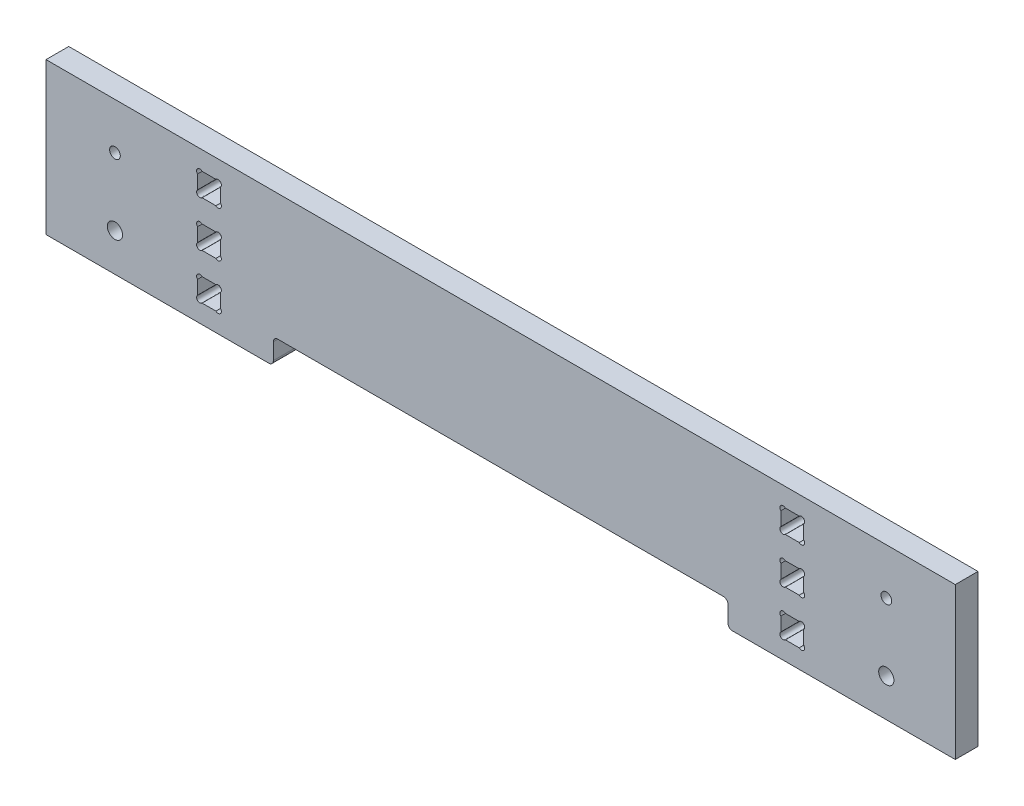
ISO-10303-21;
HEADER;
FILE_DESCRIPTION(('STEP AP214'),'2;1');
FILE_NAME('part.step','',(''),(''),'','','');
FILE_SCHEMA(('AUTOMOTIVE_DESIGN { 1 0 10303 214 1 1 1 1 }'));
ENDSEC;
DATA;
#1=APPLICATION_CONTEXT('core data for automotive mechanical design processes');
#2=APPLICATION_PROTOCOL_DEFINITION('international standard','automotive_design',2000,#1);
#3=PRODUCT_CONTEXT('',#1,'mechanical');
#4=PRODUCT('Part','Part','',(#3));
#5=PRODUCT_RELATED_PRODUCT_CATEGORY('part','',(#4));
#6=PRODUCT_DEFINITION_FORMATION('','',#4);
#7=PRODUCT_DEFINITION_CONTEXT('part definition',#1,'design');
#8=PRODUCT_DEFINITION('design','',#6,#7);
#9=PRODUCT_DEFINITION_SHAPE('','',#8);
#10=(LENGTH_UNIT() NAMED_UNIT(*) SI_UNIT(.MILLI.,.METRE.));
#11=(NAMED_UNIT(*) PLANE_ANGLE_UNIT() SI_UNIT($,.RADIAN.));
#12=(NAMED_UNIT(*) SI_UNIT($,.STERADIAN.) SOLID_ANGLE_UNIT());
#13=UNCERTAINTY_MEASURE_WITH_UNIT(LENGTH_MEASURE(1.E-05),#10,'distance_accuracy_value','');
#14=(GEOMETRIC_REPRESENTATION_CONTEXT(3) GLOBAL_UNCERTAINTY_ASSIGNED_CONTEXT((#13)) GLOBAL_UNIT_ASSIGNED_CONTEXT((#10,
#11,#12)) REPRESENTATION_CONTEXT('',''));
#15=CARTESIAN_POINT('',(0.,0.,0.));
#16=DIRECTION('',(0.,0.,1.));
#17=DIRECTION('',(1.,0.,0.));
#18=AXIS2_PLACEMENT_3D('',#15,#16,#17);
#19=CARTESIAN_POINT('',(45.5,25.,0.));
#20=DIRECTION('',(0.,0.,1.));
#21=DIRECTION('',(1.,0.,0.));
#22=AXIS2_PLACEMENT_3D('',#19,#20,#21);
#23=CYLINDRICAL_SURFACE('',#22,3.);
#24=CARTESIAN_POINT('',(45.5,25.,0.));
#25=DIRECTION('',(0.,0.,1.));
#26=DIRECTION('',(1.,0.,0.));
#27=AXIS2_PLACEMENT_3D('',#24,#25,#26);
#28=CIRCLE('',#27,3.);
#29=CARTESIAN_POINT('',(48.5,25.,0.));
#30=VERTEX_POINT('',#29);
#31=EDGE_CURVE('E843',#30,#30,#28,.T.);
#32=ORIENTED_EDGE('',*,*,#31,.F.);
#33=EDGE_LOOP('',(#32));
#34=FACE_BOUND('',#33,.T.);
#35=CARTESIAN_POINT('',(45.5,25.,7.5));
#36=DIRECTION('',(0.,0.,1.));
#37=DIRECTION('',(1.,0.,0.));
#38=AXIS2_PLACEMENT_3D('',#35,#36,#37);
#39=CIRCLE('',#38,3.);
#40=CARTESIAN_POINT('',(48.5,25.,7.5));
#41=VERTEX_POINT('',#40);
#42=EDGE_CURVE('E845',#41,#41,#39,.F.);
#43=ORIENTED_EDGE('',*,*,#42,.F.);
#44=EDGE_LOOP('',(#43));
#45=FACE_BOUND('',#44,.T.);
#46=ADVANCED_FACE('F35',(#34,#45),#23,.F.);
#47=CARTESIAN_POINT('',(554.5,25.,0.));
#48=DIRECTION('',(0.,0.,1.));
#49=DIRECTION('',(1.,0.,0.));
#50=AXIS2_PLACEMENT_3D('',#47,#48,#49);
#51=CYLINDRICAL_SURFACE('',#50,3.00000000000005);
#52=CARTESIAN_POINT('',(554.5,25.,0.));
#53=DIRECTION('',(0.,0.,1.));
#54=DIRECTION('',(1.,0.,0.));
#55=AXIS2_PLACEMENT_3D('',#52,#53,#54);
#56=CIRCLE('',#55,3.00000000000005);
#57=CARTESIAN_POINT('',(557.5,25.,0.));
#58=VERTEX_POINT('',#57);
#59=EDGE_CURVE('E1614',#58,#58,#56,.T.);
#60=ORIENTED_EDGE('',*,*,#59,.F.);
#61=EDGE_LOOP('',(#60));
#62=FACE_BOUND('',#61,.T.);
#63=CARTESIAN_POINT('',(554.5,25.,7.5));
#64=DIRECTION('',(0.,0.,1.));
#65=DIRECTION('',(1.,0.,0.));
#66=AXIS2_PLACEMENT_3D('',#63,#64,#65);
#67=CIRCLE('',#66,3.00000000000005);
#68=CARTESIAN_POINT('',(557.5,25.,7.5));
#69=VERTEX_POINT('',#68);
#70=EDGE_CURVE('E840',#69,#69,#67,.F.);
#71=ORIENTED_EDGE('',*,*,#70,.F.);
#72=EDGE_LOOP('',(#71));
#73=FACE_BOUND('',#72,.T.);
#74=ADVANCED_FACE('F936',(#62,#73),#51,.F.);
#75=CARTESIAN_POINT('',(0.,0.,15.));
#76=DIRECTION('',(0.,0.,-1.));
#77=DIRECTION('',(-1.,0.,0.));
#78=AXIS2_PLACEMENT_3D('',#75,#76,#77);
#79=PLANE('',#78);
#80=CARTESIAN_POINT('',(45.5,25.,15.));
#81=DIRECTION('',(0.,0.,1.));
#82=DIRECTION('',(1.,0.,0.));
#83=AXIS2_PLACEMENT_3D('',#80,#81,#82);
#84=CIRCLE('',#83,5.025);
#85=CARTESIAN_POINT('',(50.5249999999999,25.,15.));
#86=VERTEX_POINT('',#85);
#87=EDGE_CURVE('E1609',#86,#86,#84,.T.);
#88=ORIENTED_EDGE('',*,*,#87,.F.);
#89=EDGE_LOOP('',(#88));
#90=FACE_BOUND('',#89,.T.);
#91=CARTESIAN_POINT('',(554.5,25.,15.));
#92=DIRECTION('',(0.,0.,1.));
#93=DIRECTION('',(1.,0.,0.));
#94=AXIS2_PLACEMENT_3D('',#91,#92,#93);
#95=CIRCLE('',#94,5.025);
#96=CARTESIAN_POINT('',(559.525,25.,15.));
#97=VERTEX_POINT('',#96);
#98=EDGE_CURVE('E848',#97,#97,#95,.T.);
#99=ORIENTED_EDGE('',*,*,#98,.F.);
#100=EDGE_LOOP('',(#99));
#101=FACE_BOUND('',#100,.T.);
#102=CARTESIAN_POINT('',(554.5,69.5,15.));
#103=DIRECTION('',(0.,0.,1.));
#104=DIRECTION('',(1.,0.,0.));
#105=AXIS2_PLACEMENT_3D('',#102,#103,#104);
#106=CIRCLE('',#105,3.52500000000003);
#107=CARTESIAN_POINT('',(558.025,69.5,15.));
#108=VERTEX_POINT('',#107);
#109=EDGE_CURVE('E424',#108,#108,#106,.T.);
#110=ORIENTED_EDGE('',*,*,#109,.F.);
#111=EDGE_LOOP('',(#110));
#112=FACE_BOUND('',#111,.T.);
#113=DIRECTION('',(-1.,0.,0.));
#114=VECTOR('',#113,1.);
#115=CARTESIAN_POINT('',(112.1,27.4500000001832,15.));
#116=LINE('',#115,#114);
#117=CARTESIAN_POINT('',(112.1,27.4500000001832,15.));
#118=VERTEX_POINT('',#117);
#119=CARTESIAN_POINT('',(103.,27.4500000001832,15.));
#120=VERTEX_POINT('',#119);
#121=EDGE_CURVE('E439',#118,#120,#116,.T.);
#122=ORIENTED_EDGE('',*,*,#121,.F.);
#123=CARTESIAN_POINT('',(113.6,25.9500000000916,15.));
#124=DIRECTION('',(0.,0.,1.));
#125=DIRECTION('',(1.,0.,0.));
#126=AXIS2_PLACEMENT_3D('',#123,#124,#125);
#127=CIRCLE('',#126,2.12132034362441);
#128=CARTESIAN_POINT('',(115.1,24.45,15.));
#129=VERTEX_POINT('',#128);
#130=EDGE_CURVE('E416',#129,#118,#127,.T.);
#131=ORIENTED_EDGE('',*,*,#130,.F.);
#132=DIRECTION('',(0.,1.,0.));
#133=VECTOR('',#132,1.);
#134=CARTESIAN_POINT('',(115.1,15.35,15.));
#135=LINE('',#134,#133);
#136=CARTESIAN_POINT('',(115.1,15.35,15.));
#137=VERTEX_POINT('',#136);
#138=EDGE_CURVE('E427',#137,#129,#135,.T.);
#139=ORIENTED_EDGE('',*,*,#138,.F.);
#140=CARTESIAN_POINT('',(113.6,13.85,15.));
#141=DIRECTION('',(0.,0.,1.));
#142=DIRECTION('',(1.,0.,0.));
#143=AXIS2_PLACEMENT_3D('',#140,#141,#142);
#144=CIRCLE('',#143,2.12132034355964);
#145=CARTESIAN_POINT('',(112.1,12.35,15.));
#146=VERTEX_POINT('',#145);
#147=EDGE_CURVE('E432',#146,#137,#144,.T.);
#148=ORIENTED_EDGE('',*,*,#147,.F.);
#149=DIRECTION('',(1.,0.,0.));
#150=VECTOR('',#149,1.);
#151=CARTESIAN_POINT('',(103.,12.35,15.));
#152=LINE('',#151,#150);
#153=CARTESIAN_POINT('',(103.,12.35,15.));
#154=VERTEX_POINT('',#153);
#155=EDGE_CURVE('E1635',#154,#146,#152,.T.);
#156=ORIENTED_EDGE('',*,*,#155,.F.);
#157=CARTESIAN_POINT('',(101.5,13.85,15.));
#158=DIRECTION('',(0.,0.,1.));
#159=DIRECTION('',(1.,0.,0.));
#160=AXIS2_PLACEMENT_3D('',#157,#158,#159);
#161=CIRCLE('',#160,2.12132034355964);
#162=CARTESIAN_POINT('',(100.,15.35,15.));
#163=VERTEX_POINT('',#162);
#164=EDGE_CURVE('E1638',#163,#154,#161,.T.);
#165=ORIENTED_EDGE('',*,*,#164,.F.);
#166=DIRECTION('',(0.,-1.,0.));
#167=VECTOR('',#166,1.);
#168=CARTESIAN_POINT('',(100.,24.45,15.));
#169=LINE('',#168,#167);
#170=CARTESIAN_POINT('',(100.,24.45,15.));
#171=VERTEX_POINT('',#170);
#172=EDGE_CURVE('E1641',#171,#163,#169,.T.);
#173=ORIENTED_EDGE('',*,*,#172,.F.);
#174=CARTESIAN_POINT('',(101.5,25.9500000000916,15.));
#175=DIRECTION('',(0.,0.,-1.));
#176=DIRECTION('',(-1.,0.,0.));
#177=AXIS2_PLACEMENT_3D('',#174,#175,#176);
#178=CIRCLE('',#177,2.12132034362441);
#179=EDGE_CURVE('E444',#171,#120,#178,.T.);
#180=ORIENTED_EDGE('',*,*,#179,.T.);
#181=EDGE_LOOP('',(#122,#131,#139,#148,#156,#165,#173,#180));
#182=FACE_BOUND('',#181,.T.);
#183=CARTESIAN_POINT('',(113.6,43.9500000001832,15.));
#184=DIRECTION('',(0.,0.,1.));
#185=DIRECTION('',(1.,0.,0.));
#186=AXIS2_PLACEMENT_3D('',#183,#184,#185);
#187=CIRCLE('',#186,2.12132034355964);
#188=CARTESIAN_POINT('',(112.1,42.4500000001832,15.));
#189=VERTEX_POINT('',#188);
#190=CARTESIAN_POINT('',(115.1,45.4500000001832,15.));
#191=VERTEX_POINT('',#190);
#192=EDGE_CURVE('E504',#189,#191,#187,.T.);
#193=ORIENTED_EDGE('',*,*,#192,.F.);
#194=DIRECTION('',(1.,0.,0.));
#195=VECTOR('',#194,1.);
#196=CARTESIAN_POINT('',(103.,42.4500000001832,15.));
#197=LINE('',#196,#195);
#198=CARTESIAN_POINT('',(103.,42.4500000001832,15.));
#199=VERTEX_POINT('',#198);
#200=EDGE_CURVE('E507',#199,#189,#197,.T.);
#201=ORIENTED_EDGE('',*,*,#200,.F.);
#202=CARTESIAN_POINT('',(101.5,43.9500000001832,15.));
#203=DIRECTION('',(0.,0.,1.));
#204=DIRECTION('',(1.,0.,0.));
#205=AXIS2_PLACEMENT_3D('',#202,#203,#204);
#206=CIRCLE('',#205,2.12132034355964);
#207=CARTESIAN_POINT('',(100.,45.4500000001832,15.));
#208=VERTEX_POINT('',#207);
#209=EDGE_CURVE('E485',#208,#199,#206,.T.);
#210=ORIENTED_EDGE('',*,*,#209,.F.);
#211=DIRECTION('',(0.,-1.,0.));
#212=VECTOR('',#211,1.);
#213=CARTESIAN_POINT('',(100.,54.5500000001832,15.));
#214=LINE('',#213,#212);
#215=CARTESIAN_POINT('',(100.,54.5500000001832,15.));
#216=VERTEX_POINT('',#215);
#217=EDGE_CURVE('E488',#216,#208,#214,.T.);
#218=ORIENTED_EDGE('',*,*,#217,.F.);
#219=CARTESIAN_POINT('',(101.5,56.0500000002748,15.));
#220=DIRECTION('',(0.,0.,-1.));
#221=DIRECTION('',(-1.,0.,0.));
#222=AXIS2_PLACEMENT_3D('',#219,#220,#221);
#223=CIRCLE('',#222,2.1213203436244);
#224=CARTESIAN_POINT('',(103.,57.5500000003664,15.));
#225=VERTEX_POINT('',#224);
#226=EDGE_CURVE('E492',#216,#225,#223,.T.);
#227=ORIENTED_EDGE('',*,*,#226,.T.);
#228=DIRECTION('',(-1.,0.,0.));
#229=VECTOR('',#228,1.);
#230=CARTESIAN_POINT('',(112.1,57.5500000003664,15.));
#231=LINE('',#230,#229);
#232=CARTESIAN_POINT('',(112.1,57.5500000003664,15.));
#233=VERTEX_POINT('',#232);
#234=EDGE_CURVE('E495',#233,#225,#231,.T.);
#235=ORIENTED_EDGE('',*,*,#234,.F.);
#236=CARTESIAN_POINT('',(113.6,56.0500000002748,15.));
#237=DIRECTION('',(0.,0.,1.));
#238=DIRECTION('',(1.,0.,0.));
#239=AXIS2_PLACEMENT_3D('',#236,#237,#238);
#240=CIRCLE('',#239,2.12132034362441);
#241=CARTESIAN_POINT('',(115.1,54.5500000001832,15.));
#242=VERTEX_POINT('',#241);
#243=EDGE_CURVE('E498',#242,#233,#240,.T.);
#244=ORIENTED_EDGE('',*,*,#243,.F.);
#245=DIRECTION('',(0.,1.,0.));
#246=VECTOR('',#245,1.);
#247=CARTESIAN_POINT('',(115.1,45.4500000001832,15.));
#248=LINE('',#247,#246);
#249=EDGE_CURVE('E501',#191,#242,#248,.T.);
#250=ORIENTED_EDGE('',*,*,#249,.F.);
#251=EDGE_LOOP('',(#193,#201,#210,#218,#227,#235,#244,#250));
#252=FACE_BOUND('',#251,.T.);
#253=DIRECTION('',(1.,0.,0.));
#254=VECTOR('',#253,1.);
#255=CARTESIAN_POINT('',(103.,72.5500000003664,15.));
#256=LINE('',#255,#254);
#257=CARTESIAN_POINT('',(103.,72.5500000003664,15.));
#258=VERTEX_POINT('',#257);
#259=CARTESIAN_POINT('',(112.1,72.5500000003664,15.));
#260=VERTEX_POINT('',#259);
#261=EDGE_CURVE('E567',#258,#260,#256,.T.);
#262=ORIENTED_EDGE('',*,*,#261,.F.);
#263=CARTESIAN_POINT('',(101.5,74.0500000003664,15.));
#264=DIRECTION('',(0.,0.,1.));
#265=DIRECTION('',(1.,0.,0.));
#266=AXIS2_PLACEMENT_3D('',#263,#264,#265);
#267=CIRCLE('',#266,2.12132034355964);
#268=CARTESIAN_POINT('',(100.,75.5500000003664,15.));
#269=VERTEX_POINT('',#268);
#270=EDGE_CURVE('E570',#269,#258,#267,.T.);
#271=ORIENTED_EDGE('',*,*,#270,.F.);
#272=DIRECTION('',(0.,-1.,0.));
#273=VECTOR('',#272,1.);
#274=CARTESIAN_POINT('',(100.,84.6500000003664,15.));
#275=LINE('',#274,#273);
#276=CARTESIAN_POINT('',(100.,84.6500000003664,15.));
#277=VERTEX_POINT('',#276);
#278=EDGE_CURVE('E548',#277,#269,#275,.T.);
#279=ORIENTED_EDGE('',*,*,#278,.F.);
#280=CARTESIAN_POINT('',(101.5,86.150000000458,15.));
#281=DIRECTION('',(0.,0.,-1.));
#282=DIRECTION('',(-1.,0.,0.));
#283=AXIS2_PLACEMENT_3D('',#280,#281,#282);
#284=CIRCLE('',#283,2.12132034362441);
#285=CARTESIAN_POINT('',(103.,87.6500000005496,15.));
#286=VERTEX_POINT('',#285);
#287=EDGE_CURVE('E551',#277,#286,#284,.T.);
#288=ORIENTED_EDGE('',*,*,#287,.T.);
#289=DIRECTION('',(-1.,0.,0.));
#290=VECTOR('',#289,1.);
#291=CARTESIAN_POINT('',(112.1,87.6500000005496,15.));
#292=LINE('',#291,#290);
#293=CARTESIAN_POINT('',(112.1,87.6500000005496,15.));
#294=VERTEX_POINT('',#293);
#295=EDGE_CURVE('E555',#294,#286,#292,.T.);
#296=ORIENTED_EDGE('',*,*,#295,.F.);
#297=CARTESIAN_POINT('',(113.6,86.150000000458,15.));
#298=DIRECTION('',(0.,0.,1.));
#299=DIRECTION('',(1.,0.,0.));
#300=AXIS2_PLACEMENT_3D('',#297,#298,#299);
#301=CIRCLE('',#300,2.12132034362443);
#302=CARTESIAN_POINT('',(115.1,84.6500000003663,15.));
#303=VERTEX_POINT('',#302);
#304=EDGE_CURVE('E558',#303,#294,#301,.T.);
#305=ORIENTED_EDGE('',*,*,#304,.F.);
#306=DIRECTION('',(0.,1.,0.));
#307=VECTOR('',#306,1.);
#308=CARTESIAN_POINT('',(115.1,75.5500000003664,15.));
#309=LINE('',#308,#307);
#310=CARTESIAN_POINT('',(115.1,75.5500000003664,15.));
#311=VERTEX_POINT('',#310);
#312=EDGE_CURVE('E561',#311,#303,#309,.T.);
#313=ORIENTED_EDGE('',*,*,#312,.F.);
#314=CARTESIAN_POINT('',(113.6,74.0500000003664,15.));
#315=DIRECTION('',(0.,0.,1.));
#316=DIRECTION('',(1.,0.,0.));
#317=AXIS2_PLACEMENT_3D('',#314,#315,#316);
#318=CIRCLE('',#317,2.12132034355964);
#319=EDGE_CURVE('E564',#260,#311,#318,.T.);
#320=ORIENTED_EDGE('',*,*,#319,.F.);
#321=EDGE_LOOP('',(#262,#271,#279,#288,#296,#305,#313,#320));
#322=FACE_BOUND('',#321,.T.);
#323=CARTESIAN_POINT('',(45.5,69.5,15.));
#324=DIRECTION('',(0.,0.,1.));
#325=DIRECTION('',(1.,0.,0.));
#326=AXIS2_PLACEMENT_3D('',#323,#324,#325);
#327=CIRCLE('',#326,3.525);
#328=CARTESIAN_POINT('',(49.025,69.5,15.));
#329=VERTEX_POINT('',#328);
#330=EDGE_CURVE('E594',#329,#329,#327,.T.);
#331=ORIENTED_EDGE('',*,*,#330,.F.);
#332=EDGE_LOOP('',(#331));
#333=FACE_BOUND('',#332,.T.);
#334=CARTESIAN_POINT('',(498.5,56.0499999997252,15.));
#335=DIRECTION('',(0.,0.,1.));
#336=DIRECTION('',(1.,0.,0.));
#337=AXIS2_PLACEMENT_3D('',#334,#335,#336);
#338=CIRCLE('',#337,2.12132034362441);
#339=CARTESIAN_POINT('',(500.,54.5499999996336,15.));
#340=VERTEX_POINT('',#339);
#341=CARTESIAN_POINT('',(497.,57.5499999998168,15.));
#342=VERTEX_POINT('',#341);
#343=EDGE_CURVE('E636',#340,#342,#338,.T.);
#344=ORIENTED_EDGE('',*,*,#343,.F.);
#345=DIRECTION('',(0.,1.,0.));
#346=VECTOR('',#345,1.);
#347=CARTESIAN_POINT('',(500.,0.,15.));
#348=LINE('',#347,#346);
#349=CARTESIAN_POINT('',(500.,45.4499999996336,15.));
#350=VERTEX_POINT('',#349);
#351=EDGE_CURVE('E639',#350,#340,#348,.T.);
#352=ORIENTED_EDGE('',*,*,#351,.F.);
#353=CARTESIAN_POINT('',(498.5,43.9499999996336,15.));
#354=DIRECTION('',(0.,0.,1.));
#355=DIRECTION('',(1.,0.,0.));
#356=AXIS2_PLACEMENT_3D('',#353,#354,#355);
#357=CIRCLE('',#356,2.12132034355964);
#358=CARTESIAN_POINT('',(497.,42.4499999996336,15.));
#359=VERTEX_POINT('',#358);
#360=EDGE_CURVE('E617',#359,#350,#357,.T.);
#361=ORIENTED_EDGE('',*,*,#360,.F.);
#362=DIRECTION('',(1.,0.,0.));
#363=VECTOR('',#362,1.);
#364=CARTESIAN_POINT('',(0.,42.4499999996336,15.));
#365=LINE('',#364,#363);
#366=CARTESIAN_POINT('',(487.9,42.4499999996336,15.));
#367=VERTEX_POINT('',#366);
#368=EDGE_CURVE('E620',#367,#359,#365,.T.);
#369=ORIENTED_EDGE('',*,*,#368,.F.);
#370=CARTESIAN_POINT('',(486.4,43.9499999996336,15.));
#371=DIRECTION('',(0.,0.,1.));
#372=DIRECTION('',(1.,0.,0.));
#373=AXIS2_PLACEMENT_3D('',#370,#371,#372);
#374=CIRCLE('',#373,2.12132034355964);
#375=CARTESIAN_POINT('',(484.9,45.4499999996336,15.));
#376=VERTEX_POINT('',#375);
#377=EDGE_CURVE('E624',#376,#367,#374,.T.);
#378=ORIENTED_EDGE('',*,*,#377,.F.);
#379=DIRECTION('',(0.,-1.,0.));
#380=VECTOR('',#379,1.);
#381=CARTESIAN_POINT('',(484.9,0.,15.));
#382=LINE('',#381,#380);
#383=CARTESIAN_POINT('',(484.9,54.5499999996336,15.));
#384=VERTEX_POINT('',#383);
#385=EDGE_CURVE('E627',#384,#376,#382,.T.);
#386=ORIENTED_EDGE('',*,*,#385,.F.);
#387=CARTESIAN_POINT('',(486.4,56.0499999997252,15.));
#388=DIRECTION('',(0.,0.,1.));
#389=DIRECTION('',(1.,0.,0.));
#390=AXIS2_PLACEMENT_3D('',#387,#388,#389);
#391=CIRCLE('',#390,2.12132034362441);
#392=CARTESIAN_POINT('',(487.9,57.5499999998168,15.));
#393=VERTEX_POINT('',#392);
#394=EDGE_CURVE('E630',#384,#393,#391,.F.);
#395=ORIENTED_EDGE('',*,*,#394,.T.);
#396=DIRECTION('',(-1.,0.,0.));
#397=VECTOR('',#396,1.);
#398=CARTESIAN_POINT('',(0.,57.5499999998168,15.));
#399=LINE('',#398,#397);
#400=EDGE_CURVE('E633',#342,#393,#399,.T.);
#401=ORIENTED_EDGE('',*,*,#400,.F.);
#402=EDGE_LOOP('',(#344,#352,#361,#369,#378,#386,#395,#401));
#403=FACE_BOUND('',#402,.T.);
#404=CARTESIAN_POINT('',(498.5,25.9499999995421,15.));
#405=DIRECTION('',(0.,0.,1.));
#406=DIRECTION('',(1.,0.,0.));
#407=AXIS2_PLACEMENT_3D('',#404,#405,#406);
#408=CIRCLE('',#407,2.12132034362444);
#409=CARTESIAN_POINT('',(500.,24.4499999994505,15.));
#410=VERTEX_POINT('',#409);
#411=CARTESIAN_POINT('',(497.,27.4499999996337,15.));
#412=VERTEX_POINT('',#411);
#413=EDGE_CURVE('E699',#410,#412,#408,.T.);
#414=ORIENTED_EDGE('',*,*,#413,.F.);
#415=DIRECTION('',(0.,1.,0.));
#416=VECTOR('',#415,1.);
#417=CARTESIAN_POINT('',(500.,0.,15.));
#418=LINE('',#417,#416);
#419=CARTESIAN_POINT('',(500.,15.3499999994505,15.));
#420=VERTEX_POINT('',#419);
#421=EDGE_CURVE('E702',#420,#410,#418,.T.);
#422=ORIENTED_EDGE('',*,*,#421,.F.);
#423=CARTESIAN_POINT('',(498.5,13.8499999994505,15.));
#424=DIRECTION('',(0.,0.,1.));
#425=DIRECTION('',(1.,0.,0.));
#426=AXIS2_PLACEMENT_3D('',#423,#424,#425);
#427=CIRCLE('',#426,2.12132034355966);
#428=CARTESIAN_POINT('',(497.,12.3499999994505,15.));
#429=VERTEX_POINT('',#428);
#430=EDGE_CURVE('E680',#429,#420,#427,.T.);
#431=ORIENTED_EDGE('',*,*,#430,.F.);
#432=DIRECTION('',(1.,0.,0.));
#433=VECTOR('',#432,1.);
#434=CARTESIAN_POINT('',(0.,12.3499999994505,15.));
#435=LINE('',#434,#433);
#436=CARTESIAN_POINT('',(487.9,12.3499999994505,15.));
#437=VERTEX_POINT('',#436);
#438=EDGE_CURVE('E683',#437,#429,#435,.T.);
#439=ORIENTED_EDGE('',*,*,#438,.F.);
#440=CARTESIAN_POINT('',(486.4,13.8499999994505,15.));
#441=DIRECTION('',(0.,0.,1.));
#442=DIRECTION('',(1.,0.,0.));
#443=AXIS2_PLACEMENT_3D('',#440,#441,#442);
#444=CIRCLE('',#443,2.12132034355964);
#445=CARTESIAN_POINT('',(484.9,15.3499999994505,15.));
#446=VERTEX_POINT('',#445);
#447=EDGE_CURVE('E687',#446,#437,#444,.T.);
#448=ORIENTED_EDGE('',*,*,#447,.F.);
#449=DIRECTION('',(0.,-1.,0.));
#450=VECTOR('',#449,1.);
#451=CARTESIAN_POINT('',(484.9,0.,15.));
#452=LINE('',#451,#450);
#453=CARTESIAN_POINT('',(484.9,24.4499999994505,15.));
#454=VERTEX_POINT('',#453);
#455=EDGE_CURVE('E690',#454,#446,#452,.T.);
#456=ORIENTED_EDGE('',*,*,#455,.F.);
#457=CARTESIAN_POINT('',(486.4,25.9499999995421,15.));
#458=DIRECTION('',(0.,0.,1.));
#459=DIRECTION('',(1.,0.,0.));
#460=AXIS2_PLACEMENT_3D('',#457,#458,#459);
#461=CIRCLE('',#460,2.12132034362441);
#462=CARTESIAN_POINT('',(487.9,27.4499999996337,15.));
#463=VERTEX_POINT('',#462);
#464=EDGE_CURVE('E693',#454,#463,#461,.F.);
#465=ORIENTED_EDGE('',*,*,#464,.T.);
#466=DIRECTION('',(-1.,0.,0.));
#467=VECTOR('',#466,1.);
#468=CARTESIAN_POINT('',(0.,27.4499999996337,15.));
#469=LINE('',#468,#467);
#470=EDGE_CURVE('E696',#412,#463,#469,.T.);
#471=ORIENTED_EDGE('',*,*,#470,.F.);
#472=EDGE_LOOP('',(#414,#422,#431,#439,#448,#456,#465,#471));
#473=FACE_BOUND('',#472,.T.);
#474=DIRECTION('',(0.,-1.,0.));
#475=VECTOR('',#474,1.);
#476=CARTESIAN_POINT('',(450.,16.7043263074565,15.));
#477=LINE('',#476,#475);
#478=CARTESIAN_POINT('',(450.,13.7043263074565,15.));
#479=VERTEX_POINT('',#478);
#480=CARTESIAN_POINT('',(450.,3.,15.));
#481=VERTEX_POINT('',#480);
#482=EDGE_CURVE('E800',#479,#481,#477,.T.);
#483=ORIENTED_EDGE('',*,*,#482,.T.);
#484=CARTESIAN_POINT('',(453.,3.,15.));
#485=DIRECTION('',(0.,0.,-1.));
#486=DIRECTION('',(-1.,0.,0.));
#487=AXIS2_PLACEMENT_3D('',#484,#485,#486);
#488=CIRCLE('',#487,3.);
#489=CARTESIAN_POINT('',(453.,0.,15.));
#490=VERTEX_POINT('',#489);
#491=EDGE_CURVE('E867',#481,#490,#488,.F.);
#492=ORIENTED_EDGE('',*,*,#491,.T.);
#493=DIRECTION('',(1.,0.,0.));
#494=VECTOR('',#493,1.);
#495=CARTESIAN_POINT('',(450.,0.,15.));
#496=LINE('',#495,#494);
#497=CARTESIAN_POINT('',(600.,0.,15.));
#498=VERTEX_POINT('',#497);
#499=EDGE_CURVE('E803',#490,#498,#496,.T.);
#500=ORIENTED_EDGE('',*,*,#499,.T.);
#501=DIRECTION('',(0.,1.,0.));
#502=VECTOR('',#501,1.);
#503=CARTESIAN_POINT('',(600.,0.,15.));
#504=LINE('',#503,#502);
#505=CARTESIAN_POINT('',(600.,100.,15.));
#506=VERTEX_POINT('',#505);
#507=EDGE_CURVE('E805',#498,#506,#504,.T.);
#508=ORIENTED_EDGE('',*,*,#507,.T.);
#509=DIRECTION('',(-1.,0.,0.));
#510=VECTOR('',#509,1.);
#511=CARTESIAN_POINT('',(0.,100.,15.));
#512=LINE('',#511,#510);
#513=CARTESIAN_POINT('',(0.,100.,15.));
#514=VERTEX_POINT('',#513);
#515=EDGE_CURVE('E807',#506,#514,#512,.T.);
#516=ORIENTED_EDGE('',*,*,#515,.T.);
#517=DIRECTION('',(0.,-1.,0.));
#518=VECTOR('',#517,1.);
#519=CARTESIAN_POINT('',(0.,0.,15.));
#520=LINE('',#519,#518);
#521=CARTESIAN_POINT('',(0.,0.,15.));
#522=VERTEX_POINT('',#521);
#523=EDGE_CURVE('E789',#514,#522,#520,.T.);
#524=ORIENTED_EDGE('',*,*,#523,.T.);
#525=DIRECTION('',(1.,0.,0.));
#526=VECTOR('',#525,1.);
#527=CARTESIAN_POINT('',(0.,0.,15.));
#528=LINE('',#527,#526);
#529=CARTESIAN_POINT('',(147.,0.,15.));
#530=VERTEX_POINT('',#529);
#531=EDGE_CURVE('E792',#522,#530,#528,.T.);
#532=ORIENTED_EDGE('',*,*,#531,.T.);
#533=CARTESIAN_POINT('',(147.,3.,15.));
#534=DIRECTION('',(0.,0.,-1.));
#535=DIRECTION('',(-1.,0.,0.));
#536=AXIS2_PLACEMENT_3D('',#533,#534,#535);
#537=CIRCLE('',#536,3.);
#538=CARTESIAN_POINT('',(150.,3.,15.));
#539=VERTEX_POINT('',#538);
#540=EDGE_CURVE('E57',#530,#539,#537,.F.);
#541=ORIENTED_EDGE('',*,*,#540,.T.);
#542=DIRECTION('',(0.,1.,0.));
#543=VECTOR('',#542,1.);
#544=CARTESIAN_POINT('',(150.,0.,15.));
#545=LINE('',#544,#543);
#546=CARTESIAN_POINT('',(150.,13.7043263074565,15.));
#547=VERTEX_POINT('',#546);
#548=EDGE_CURVE('E795',#539,#547,#545,.T.);
#549=ORIENTED_EDGE('',*,*,#548,.T.);
#550=CARTESIAN_POINT('',(153.,13.7043263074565,15.));
#551=DIRECTION('',(0.,0.,-1.));
#552=DIRECTION('',(-1.,0.,0.));
#553=AXIS2_PLACEMENT_3D('',#550,#551,#552);
#554=CIRCLE('',#553,3.);
#555=CARTESIAN_POINT('',(153.,16.7043263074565,15.));
#556=VERTEX_POINT('',#555);
#557=EDGE_CURVE('E11',#547,#556,#554,.T.);
#558=ORIENTED_EDGE('',*,*,#557,.T.);
#559=DIRECTION('',(1.,0.,0.));
#560=VECTOR('',#559,1.);
#561=CARTESIAN_POINT('',(150.,16.7043263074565,15.));
#562=LINE('',#561,#560);
#563=CARTESIAN_POINT('',(447.,16.7043263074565,15.));
#564=VERTEX_POINT('',#563);
#565=EDGE_CURVE('E797',#556,#564,#562,.T.);
#566=ORIENTED_EDGE('',*,*,#565,.T.);
#567=CARTESIAN_POINT('',(447.,13.7043263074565,15.));
#568=DIRECTION('',(0.,0.,-1.));
#569=DIRECTION('',(-1.,0.,0.));
#570=AXIS2_PLACEMENT_3D('',#567,#568,#569);
#571=CIRCLE('',#570,3.);
#572=EDGE_CURVE('E877',#564,#479,#571,.T.);
#573=ORIENTED_EDGE('',*,*,#572,.T.);
#574=EDGE_LOOP('',(#483,#492,#500,#508,#516,#524,#532,#541,#549,#558,#566,#573));
#575=FACE_BOUND('',#574,.T.);
#576=DIRECTION('',(0.,-1.,0.));
#577=VECTOR('',#576,1.);
#578=CARTESIAN_POINT('',(500.,0.,15.));
#579=LINE('',#578,#577);
#580=CARTESIAN_POINT('',(500.,84.6499999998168,15.));
#581=VERTEX_POINT('',#580);
#582=CARTESIAN_POINT('',(500.,75.5499999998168,15.));
#583=VERTEX_POINT('',#582);
#584=EDGE_CURVE('E704',#581,#583,#579,.T.);
#585=ORIENTED_EDGE('',*,*,#584,.T.);
#586=CARTESIAN_POINT('',(498.5,74.0499999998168,15.));
#587=DIRECTION('',(0.,0.,1.));
#588=DIRECTION('',(1.,0.,0.));
#589=AXIS2_PLACEMENT_3D('',#586,#587,#588);
#590=CIRCLE('',#589,2.12132034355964);
#591=CARTESIAN_POINT('',(497.,72.5499999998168,15.));
#592=VERTEX_POINT('',#591);
#593=EDGE_CURVE('E729',#592,#583,#590,.T.);
#594=ORIENTED_EDGE('',*,*,#593,.F.);
#595=DIRECTION('',(1.,0.,0.));
#596=VECTOR('',#595,1.);
#597=CARTESIAN_POINT('',(0.,72.5499999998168,15.));
#598=LINE('',#597,#596);
#599=CARTESIAN_POINT('',(487.9,72.5499999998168,15.));
#600=VERTEX_POINT('',#599);
#601=EDGE_CURVE('E767',#600,#592,#598,.T.);
#602=ORIENTED_EDGE('',*,*,#601,.F.);
#603=CARTESIAN_POINT('',(486.4,74.0499999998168,15.));
#604=DIRECTION('',(0.,0.,1.));
#605=DIRECTION('',(1.,0.,0.));
#606=AXIS2_PLACEMENT_3D('',#603,#604,#605);
#607=CIRCLE('',#606,2.12132034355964);
#608=CARTESIAN_POINT('',(484.9,75.5499999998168,15.));
#609=VERTEX_POINT('',#608);
#610=EDGE_CURVE('E764',#609,#600,#607,.T.);
#611=ORIENTED_EDGE('',*,*,#610,.F.);
#612=DIRECTION('',(0.,-1.,0.));
#613=VECTOR('',#612,1.);
#614=CARTESIAN_POINT('',(484.9,0.,15.));
#615=LINE('',#614,#613);
#616=CARTESIAN_POINT('',(484.9,84.6499999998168,15.));
#617=VERTEX_POINT('',#616);
#618=EDGE_CURVE('E761',#617,#609,#615,.T.);
#619=ORIENTED_EDGE('',*,*,#618,.F.);
#620=CARTESIAN_POINT('',(486.4,86.1499999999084,15.));
#621=DIRECTION('',(0.,0.,1.));
#622=DIRECTION('',(1.,0.,0.));
#623=AXIS2_PLACEMENT_3D('',#620,#621,#622);
#624=CIRCLE('',#623,2.12132034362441);
#625=CARTESIAN_POINT('',(487.9,87.65,15.));
#626=VERTEX_POINT('',#625);
#627=EDGE_CURVE('E758',#617,#626,#624,.F.);
#628=ORIENTED_EDGE('',*,*,#627,.T.);
#629=DIRECTION('',(-1.,0.,0.));
#630=VECTOR('',#629,1.);
#631=CARTESIAN_POINT('',(0.,87.65,15.));
#632=LINE('',#631,#630);
#633=CARTESIAN_POINT('',(497.,87.65,15.));
#634=VERTEX_POINT('',#633);
#635=EDGE_CURVE('E755',#634,#626,#632,.T.);
#636=ORIENTED_EDGE('',*,*,#635,.F.);
#637=CARTESIAN_POINT('',(498.5,86.1499999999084,15.));
#638=DIRECTION('',(0.,0.,1.));
#639=DIRECTION('',(1.,0.,0.));
#640=AXIS2_PLACEMENT_3D('',#637,#638,#639);
#641=CIRCLE('',#640,2.12132034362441);
#642=EDGE_CURVE('E752',#581,#634,#641,.T.);
#643=ORIENTED_EDGE('',*,*,#642,.F.);
#644=EDGE_LOOP('',(#585,#594,#602,#611,#619,#628,#636,#643));
#645=FACE_BOUND('',#644,.T.);
#646=ADVANCED_FACE('F435',(#90,#101,#112,#182,#252,#322,#333,#403,#473,#575,#645),#79,.F.);
#647=CARTESIAN_POINT('',(0.,0.,0.));
#648=DIRECTION('',(0.,0.,-1.));
#649=DIRECTION('',(-1.,0.,0.));
#650=AXIS2_PLACEMENT_3D('',#647,#648,#649);
#651=PLANE('',#650);
#652=ORIENTED_EDGE('',*,*,#31,.T.);
#653=EDGE_LOOP('',(#652));
#654=FACE_BOUND('',#653,.T.);
#655=ORIENTED_EDGE('',*,*,#59,.T.);
#656=EDGE_LOOP('',(#655));
#657=FACE_BOUND('',#656,.T.);
#658=CARTESIAN_POINT('',(554.5,69.5,0.));
#659=DIRECTION('',(0.,0.,1.));
#660=DIRECTION('',(1.,0.,0.));
#661=AXIS2_PLACEMENT_3D('',#658,#659,#660);
#662=CIRCLE('',#661,3.52500000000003);
#663=CARTESIAN_POINT('',(558.025,69.5,0.));
#664=VERTEX_POINT('',#663);
#665=EDGE_CURVE('E1617',#664,#664,#662,.T.);
#666=ORIENTED_EDGE('',*,*,#665,.T.);
#667=EDGE_LOOP('',(#666));
#668=FACE_BOUND('',#667,.T.);
#669=CARTESIAN_POINT('',(113.6,25.9500000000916,0.));
#670=DIRECTION('',(0.,0.,1.));
#671=DIRECTION('',(1.,0.,0.));
#672=AXIS2_PLACEMENT_3D('',#669,#670,#671);
#673=CIRCLE('',#672,2.12132034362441);
#674=CARTESIAN_POINT('',(115.1,24.45,0.));
#675=VERTEX_POINT('',#674);
#676=CARTESIAN_POINT('',(112.1,27.4500000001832,0.));
#677=VERTEX_POINT('',#676);
#678=EDGE_CURVE('E419',#675,#677,#673,.T.);
#679=ORIENTED_EDGE('',*,*,#678,.T.);
#680=DIRECTION('',(-1.,0.,0.));
#681=VECTOR('',#680,1.);
#682=CARTESIAN_POINT('',(112.1,27.4500000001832,0.));
#683=LINE('',#682,#681);
#684=CARTESIAN_POINT('',(103.,27.4500000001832,0.));
#685=VERTEX_POINT('',#684);
#686=EDGE_CURVE('E466',#677,#685,#683,.T.);
#687=ORIENTED_EDGE('',*,*,#686,.T.);
#688=CARTESIAN_POINT('',(101.5,25.9500000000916,0.));
#689=DIRECTION('',(0.,0.,-1.));
#690=DIRECTION('',(-1.,0.,0.));
#691=AXIS2_PLACEMENT_3D('',#688,#689,#690);
#692=CIRCLE('',#691,2.12132034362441);
#693=CARTESIAN_POINT('',(100.,24.45,0.));
#694=VERTEX_POINT('',#693);
#695=EDGE_CURVE('E463',#694,#685,#692,.T.);
#696=ORIENTED_EDGE('',*,*,#695,.F.);
#697=DIRECTION('',(0.,-1.,0.));
#698=VECTOR('',#697,1.);
#699=CARTESIAN_POINT('',(100.,24.45,0.));
#700=LINE('',#699,#698);
#701=CARTESIAN_POINT('',(100.,15.35,0.));
#702=VERTEX_POINT('',#701);
#703=EDGE_CURVE('E460',#694,#702,#700,.T.);
#704=ORIENTED_EDGE('',*,*,#703,.T.);
#705=CARTESIAN_POINT('',(101.5,13.85,0.));
#706=DIRECTION('',(0.,0.,1.));
#707=DIRECTION('',(1.,0.,0.));
#708=AXIS2_PLACEMENT_3D('',#705,#706,#707);
#709=CIRCLE('',#708,2.12132034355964);
#710=CARTESIAN_POINT('',(103.,12.35,0.));
#711=VERTEX_POINT('',#710);
#712=EDGE_CURVE('E457',#702,#711,#709,.T.);
#713=ORIENTED_EDGE('',*,*,#712,.T.);
#714=DIRECTION('',(1.,0.,0.));
#715=VECTOR('',#714,1.);
#716=CARTESIAN_POINT('',(103.,12.35,0.));
#717=LINE('',#716,#715);
#718=CARTESIAN_POINT('',(112.1,12.35,0.));
#719=VERTEX_POINT('',#718);
#720=EDGE_CURVE('E454',#711,#719,#717,.T.);
#721=ORIENTED_EDGE('',*,*,#720,.T.);
#722=CARTESIAN_POINT('',(113.6,13.85,0.));
#723=DIRECTION('',(0.,0.,1.));
#724=DIRECTION('',(1.,0.,0.));
#725=AXIS2_PLACEMENT_3D('',#722,#723,#724);
#726=CIRCLE('',#725,2.12132034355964);
#727=CARTESIAN_POINT('',(115.1,15.35,0.));
#728=VERTEX_POINT('',#727);
#729=EDGE_CURVE('E450',#719,#728,#726,.T.);
#730=ORIENTED_EDGE('',*,*,#729,.T.);
#731=DIRECTION('',(0.,1.,0.));
#732=VECTOR('',#731,1.);
#733=CARTESIAN_POINT('',(115.1,15.35,0.));
#734=LINE('',#733,#732);
#735=EDGE_CURVE('E448',#728,#675,#734,.T.);
#736=ORIENTED_EDGE('',*,*,#735,.T.);
#737=EDGE_LOOP('',(#679,#687,#696,#704,#713,#721,#730,#736));
#738=FACE_BOUND('',#737,.T.);
#739=DIRECTION('',(1.,0.,0.));
#740=VECTOR('',#739,1.);
#741=CARTESIAN_POINT('',(103.,42.4500000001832,0.));
#742=LINE('',#741,#740);
#743=CARTESIAN_POINT('',(103.,42.4500000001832,0.));
#744=VERTEX_POINT('',#743);
#745=CARTESIAN_POINT('',(112.1,42.4500000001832,0.));
#746=VERTEX_POINT('',#745);
#747=EDGE_CURVE('E489',#744,#746,#742,.T.);
#748=ORIENTED_EDGE('',*,*,#747,.T.);
#749=CARTESIAN_POINT('',(113.6,43.9500000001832,0.));
#750=DIRECTION('',(0.,0.,1.));
#751=DIRECTION('',(1.,0.,0.));
#752=AXIS2_PLACEMENT_3D('',#749,#750,#751);
#753=CIRCLE('',#752,2.12132034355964);
#754=CARTESIAN_POINT('',(115.1,45.4500000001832,0.));
#755=VERTEX_POINT('',#754);
#756=EDGE_CURVE('E526',#746,#755,#753,.T.);
#757=ORIENTED_EDGE('',*,*,#756,.T.);
#758=DIRECTION('',(0.,1.,0.));
#759=VECTOR('',#758,1.);
#760=CARTESIAN_POINT('',(115.1,45.4500000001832,0.));
#761=LINE('',#760,#759);
#762=CARTESIAN_POINT('',(115.1,54.5500000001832,0.));
#763=VERTEX_POINT('',#762);
#764=EDGE_CURVE('E523',#755,#763,#761,.T.);
#765=ORIENTED_EDGE('',*,*,#764,.T.);
#766=CARTESIAN_POINT('',(113.6,56.0500000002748,0.));
#767=DIRECTION('',(0.,0.,1.));
#768=DIRECTION('',(1.,0.,0.));
#769=AXIS2_PLACEMENT_3D('',#766,#767,#768);
#770=CIRCLE('',#769,2.12132034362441);
#771=CARTESIAN_POINT('',(112.1,57.5500000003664,0.));
#772=VERTEX_POINT('',#771);
#773=EDGE_CURVE('E520',#763,#772,#770,.T.);
#774=ORIENTED_EDGE('',*,*,#773,.T.);
#775=DIRECTION('',(-1.,0.,0.));
#776=VECTOR('',#775,1.);
#777=CARTESIAN_POINT('',(112.1,57.5500000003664,0.));
#778=LINE('',#777,#776);
#779=CARTESIAN_POINT('',(103.,57.5500000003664,0.));
#780=VERTEX_POINT('',#779);
#781=EDGE_CURVE('E517',#772,#780,#778,.T.);
#782=ORIENTED_EDGE('',*,*,#781,.T.);
#783=CARTESIAN_POINT('',(101.5,56.0500000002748,0.));
#784=DIRECTION('',(0.,0.,-1.));
#785=DIRECTION('',(-1.,0.,0.));
#786=AXIS2_PLACEMENT_3D('',#783,#784,#785);
#787=CIRCLE('',#786,2.1213203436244);
#788=CARTESIAN_POINT('',(100.,54.5500000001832,0.));
#789=VERTEX_POINT('',#788);
#790=EDGE_CURVE('E515',#789,#780,#787,.T.);
#791=ORIENTED_EDGE('',*,*,#790,.F.);
#792=DIRECTION('',(0.,-1.,0.));
#793=VECTOR('',#792,1.);
#794=CARTESIAN_POINT('',(100.,54.5500000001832,0.));
#795=LINE('',#794,#793);
#796=CARTESIAN_POINT('',(100.,45.4500000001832,0.));
#797=VERTEX_POINT('',#796);
#798=EDGE_CURVE('E512',#789,#797,#795,.T.);
#799=ORIENTED_EDGE('',*,*,#798,.T.);
#800=CARTESIAN_POINT('',(101.5,43.9500000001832,0.));
#801=DIRECTION('',(0.,0.,1.));
#802=DIRECTION('',(1.,0.,0.));
#803=AXIS2_PLACEMENT_3D('',#800,#801,#802);
#804=CIRCLE('',#803,2.12132034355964);
#805=EDGE_CURVE('E473',#797,#744,#804,.T.);
#806=ORIENTED_EDGE('',*,*,#805,.T.);
#807=EDGE_LOOP('',(#748,#757,#765,#774,#782,#791,#799,#806));
#808=FACE_BOUND('',#807,.T.);
#809=CARTESIAN_POINT('',(101.5,74.0500000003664,0.));
#810=DIRECTION('',(0.,0.,1.));
#811=DIRECTION('',(1.,0.,0.));
#812=AXIS2_PLACEMENT_3D('',#809,#810,#811);
#813=CIRCLE('',#812,2.12132034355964);
#814=CARTESIAN_POINT('',(100.,75.5500000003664,0.));
#815=VERTEX_POINT('',#814);
#816=CARTESIAN_POINT('',(103.,72.5500000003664,0.));
#817=VERTEX_POINT('',#816);
#818=EDGE_CURVE('E552',#815,#817,#813,.T.);
#819=ORIENTED_EDGE('',*,*,#818,.T.);
#820=DIRECTION('',(1.,0.,0.));
#821=VECTOR('',#820,1.);
#822=CARTESIAN_POINT('',(103.,72.5500000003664,0.));
#823=LINE('',#822,#821);
#824=CARTESIAN_POINT('',(112.1,72.5500000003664,0.));
#825=VERTEX_POINT('',#824);
#826=EDGE_CURVE('E589',#817,#825,#823,.T.);
#827=ORIENTED_EDGE('',*,*,#826,.T.);
#828=CARTESIAN_POINT('',(113.6,74.0500000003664,0.));
#829=DIRECTION('',(0.,0.,1.));
#830=DIRECTION('',(1.,0.,0.));
#831=AXIS2_PLACEMENT_3D('',#828,#829,#830);
#832=CIRCLE('',#831,2.12132034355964);
#833=CARTESIAN_POINT('',(115.1,75.5500000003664,0.));
#834=VERTEX_POINT('',#833);
#835=EDGE_CURVE('E586',#825,#834,#832,.T.);
#836=ORIENTED_EDGE('',*,*,#835,.T.);
#837=DIRECTION('',(0.,1.,0.));
#838=VECTOR('',#837,1.);
#839=CARTESIAN_POINT('',(115.1,75.5500000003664,0.));
#840=LINE('',#839,#838);
#841=CARTESIAN_POINT('',(115.1,84.6500000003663,0.));
#842=VERTEX_POINT('',#841);
#843=EDGE_CURVE('E583',#834,#842,#840,.T.);
#844=ORIENTED_EDGE('',*,*,#843,.T.);
#845=CARTESIAN_POINT('',(113.6,86.150000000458,0.));
#846=DIRECTION('',(0.,0.,1.));
#847=DIRECTION('',(1.,0.,0.));
#848=AXIS2_PLACEMENT_3D('',#845,#846,#847);
#849=CIRCLE('',#848,2.12132034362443);
#850=CARTESIAN_POINT('',(112.1,87.6500000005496,0.));
#851=VERTEX_POINT('',#850);
#852=EDGE_CURVE('E580',#842,#851,#849,.T.);
#853=ORIENTED_EDGE('',*,*,#852,.T.);
#854=DIRECTION('',(-1.,0.,0.));
#855=VECTOR('',#854,1.);
#856=CARTESIAN_POINT('',(112.1,87.6500000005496,0.));
#857=LINE('',#856,#855);
#858=CARTESIAN_POINT('',(103.,87.6500000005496,0.));
#859=VERTEX_POINT('',#858);
#860=EDGE_CURVE('E577',#851,#859,#857,.T.);
#861=ORIENTED_EDGE('',*,*,#860,.T.);
#862=CARTESIAN_POINT('',(101.5,86.150000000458,0.));
#863=DIRECTION('',(0.,0.,-1.));
#864=DIRECTION('',(-1.,0.,0.));
#865=AXIS2_PLACEMENT_3D('',#862,#863,#864);
#866=CIRCLE('',#865,2.12132034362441);
#867=CARTESIAN_POINT('',(100.,84.6500000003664,0.));
#868=VERTEX_POINT('',#867);
#869=EDGE_CURVE('E575',#868,#859,#866,.T.);
#870=ORIENTED_EDGE('',*,*,#869,.F.);
#871=DIRECTION('',(0.,-1.,0.));
#872=VECTOR('',#871,1.);
#873=CARTESIAN_POINT('',(100.,84.6500000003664,0.));
#874=LINE('',#873,#872);
#875=EDGE_CURVE('E534',#868,#815,#874,.T.);
#876=ORIENTED_EDGE('',*,*,#875,.T.);
#877=EDGE_LOOP('',(#819,#827,#836,#844,#853,#861,#870,#876));
#878=FACE_BOUND('',#877,.T.);
#879=CARTESIAN_POINT('',(45.5,69.5,0.));
#880=DIRECTION('',(0.,0.,1.));
#881=DIRECTION('',(1.,0.,0.));
#882=AXIS2_PLACEMENT_3D('',#879,#880,#881);
#883=CIRCLE('',#882,3.525);
#884=CARTESIAN_POINT('',(49.025,69.5,0.));
#885=VERTEX_POINT('',#884);
#886=EDGE_CURVE('E572',#885,#885,#883,.T.);
#887=ORIENTED_EDGE('',*,*,#886,.T.);
#888=EDGE_LOOP('',(#887));
#889=FACE_BOUND('',#888,.T.);
#890=DIRECTION('',(0.,1.,0.));
#891=VECTOR('',#890,1.);
#892=CARTESIAN_POINT('',(500.,0.,0.));
#893=LINE('',#892,#891);
#894=CARTESIAN_POINT('',(500.,45.4499999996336,0.));
#895=VERTEX_POINT('',#894);
#896=CARTESIAN_POINT('',(500.,54.5499999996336,0.));
#897=VERTEX_POINT('',#896);
#898=EDGE_CURVE('E621',#895,#897,#893,.T.);
#899=ORIENTED_EDGE('',*,*,#898,.T.);
#900=CARTESIAN_POINT('',(498.5,56.0499999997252,0.));
#901=DIRECTION('',(0.,0.,1.));
#902=DIRECTION('',(1.,0.,0.));
#903=AXIS2_PLACEMENT_3D('',#900,#901,#902);
#904=CIRCLE('',#903,2.12132034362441);
#905=CARTESIAN_POINT('',(497.,57.5499999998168,0.));
#906=VERTEX_POINT('',#905);
#907=EDGE_CURVE('E658',#897,#906,#904,.T.);
#908=ORIENTED_EDGE('',*,*,#907,.T.);
#909=DIRECTION('',(-1.,0.,0.));
#910=VECTOR('',#909,1.);
#911=CARTESIAN_POINT('',(0.,57.5499999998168,0.));
#912=LINE('',#911,#910);
#913=CARTESIAN_POINT('',(487.9,57.5499999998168,0.));
#914=VERTEX_POINT('',#913);
#915=EDGE_CURVE('E655',#906,#914,#912,.T.);
#916=ORIENTED_EDGE('',*,*,#915,.T.);
#917=CARTESIAN_POINT('',(486.4,56.0499999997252,0.));
#918=DIRECTION('',(0.,0.,1.));
#919=DIRECTION('',(1.,0.,0.));
#920=AXIS2_PLACEMENT_3D('',#917,#918,#919);
#921=CIRCLE('',#920,2.12132034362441);
#922=CARTESIAN_POINT('',(484.9,54.5499999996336,0.));
#923=VERTEX_POINT('',#922);
#924=EDGE_CURVE('E653',#923,#914,#921,.F.);
#925=ORIENTED_EDGE('',*,*,#924,.F.);
#926=DIRECTION('',(0.,-1.,0.));
#927=VECTOR('',#926,1.);
#928=CARTESIAN_POINT('',(484.9,0.,0.));
#929=LINE('',#928,#927);
#930=CARTESIAN_POINT('',(484.9,45.4499999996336,0.));
#931=VERTEX_POINT('',#930);
#932=EDGE_CURVE('E650',#923,#931,#929,.T.);
#933=ORIENTED_EDGE('',*,*,#932,.T.);
#934=CARTESIAN_POINT('',(486.4,43.9499999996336,0.));
#935=DIRECTION('',(0.,0.,1.));
#936=DIRECTION('',(1.,0.,0.));
#937=AXIS2_PLACEMENT_3D('',#934,#935,#936);
#938=CIRCLE('',#937,2.12132034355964);
#939=CARTESIAN_POINT('',(487.9,42.4499999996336,0.));
#940=VERTEX_POINT('',#939);
#941=EDGE_CURVE('E647',#931,#940,#938,.T.);
#942=ORIENTED_EDGE('',*,*,#941,.T.);
#943=DIRECTION('',(1.,0.,0.));
#944=VECTOR('',#943,1.);
#945=CARTESIAN_POINT('',(0.,42.4499999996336,0.));
#946=LINE('',#945,#944);
#947=CARTESIAN_POINT('',(497.,42.4499999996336,0.));
#948=VERTEX_POINT('',#947);
#949=EDGE_CURVE('E644',#940,#948,#946,.T.);
#950=ORIENTED_EDGE('',*,*,#949,.T.);
#951=CARTESIAN_POINT('',(498.5,43.9499999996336,0.));
#952=DIRECTION('',(0.,0.,1.));
#953=DIRECTION('',(1.,0.,0.));
#954=AXIS2_PLACEMENT_3D('',#951,#952,#953);
#955=CIRCLE('',#954,2.12132034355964);
#956=EDGE_CURVE('E603',#948,#895,#955,.T.);
#957=ORIENTED_EDGE('',*,*,#956,.T.);
#958=EDGE_LOOP('',(#899,#908,#916,#925,#933,#942,#950,#957));
#959=FACE_BOUND('',#958,.T.);
#960=DIRECTION('',(0.,1.,0.));
#961=VECTOR('',#960,1.);
#962=CARTESIAN_POINT('',(500.,0.,0.));
#963=LINE('',#962,#961);
#964=CARTESIAN_POINT('',(500.,15.3499999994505,0.));
#965=VERTEX_POINT('',#964);
#966=CARTESIAN_POINT('',(500.,24.4499999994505,0.));
#967=VERTEX_POINT('',#966);
#968=EDGE_CURVE('E684',#965,#967,#963,.T.);
#969=ORIENTED_EDGE('',*,*,#968,.T.);
#970=CARTESIAN_POINT('',(498.5,25.9499999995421,0.));
#971=DIRECTION('',(0.,0.,1.));
#972=DIRECTION('',(1.,0.,0.));
#973=AXIS2_PLACEMENT_3D('',#970,#971,#972);
#974=CIRCLE('',#973,2.12132034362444);
#975=CARTESIAN_POINT('',(497.,27.4499999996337,0.));
#976=VERTEX_POINT('',#975);
#977=EDGE_CURVE('E721',#967,#976,#974,.T.);
#978=ORIENTED_EDGE('',*,*,#977,.T.);
#979=DIRECTION('',(-1.,0.,0.));
#980=VECTOR('',#979,1.);
#981=CARTESIAN_POINT('',(0.,27.4499999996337,0.));
#982=LINE('',#981,#980);
#983=CARTESIAN_POINT('',(487.9,27.4499999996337,0.));
#984=VERTEX_POINT('',#983);
#985=EDGE_CURVE('E718',#976,#984,#982,.T.);
#986=ORIENTED_EDGE('',*,*,#985,.T.);
#987=CARTESIAN_POINT('',(486.4,25.9499999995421,0.));
#988=DIRECTION('',(0.,0.,1.));
#989=DIRECTION('',(1.,0.,0.));
#990=AXIS2_PLACEMENT_3D('',#987,#988,#989);
#991=CIRCLE('',#990,2.12132034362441);
#992=CARTESIAN_POINT('',(484.9,24.4499999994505,0.));
#993=VERTEX_POINT('',#992);
#994=EDGE_CURVE('E716',#993,#984,#991,.F.);
#995=ORIENTED_EDGE('',*,*,#994,.F.);
#996=DIRECTION('',(0.,-1.,0.));
#997=VECTOR('',#996,1.);
#998=CARTESIAN_POINT('',(484.9,0.,0.));
#999=LINE('',#998,#997);
#1000=CARTESIAN_POINT('',(484.9,15.3499999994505,0.));
#1001=VERTEX_POINT('',#1000);
#1002=EDGE_CURVE('E713',#993,#1001,#999,.T.);
#1003=ORIENTED_EDGE('',*,*,#1002,.T.);
#1004=CARTESIAN_POINT('',(486.4,13.8499999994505,0.));
#1005=DIRECTION('',(0.,0.,1.));
#1006=DIRECTION('',(1.,0.,0.));
#1007=AXIS2_PLACEMENT_3D('',#1004,#1005,#1006);
#1008=CIRCLE('',#1007,2.12132034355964);
#1009=CARTESIAN_POINT('',(487.9,12.3499999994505,0.));
#1010=VERTEX_POINT('',#1009);
#1011=EDGE_CURVE('E710',#1001,#1010,#1008,.T.);
#1012=ORIENTED_EDGE('',*,*,#1011,.T.);
#1013=DIRECTION('',(1.,0.,0.));
#1014=VECTOR('',#1013,1.);
#1015=CARTESIAN_POINT('',(0.,12.3499999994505,0.));
#1016=LINE('',#1015,#1014);
#1017=CARTESIAN_POINT('',(497.,12.3499999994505,0.));
#1018=VERTEX_POINT('',#1017);
#1019=EDGE_CURVE('E707',#1010,#1018,#1016,.T.);
#1020=ORIENTED_EDGE('',*,*,#1019,.T.);
#1021=CARTESIAN_POINT('',(498.5,13.8499999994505,0.));
#1022=DIRECTION('',(0.,0.,1.));
#1023=DIRECTION('',(1.,0.,0.));
#1024=AXIS2_PLACEMENT_3D('',#1021,#1022,#1023);
#1025=CIRCLE('',#1024,2.12132034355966);
#1026=EDGE_CURVE('E666',#1018,#965,#1025,.T.);
#1027=ORIENTED_EDGE('',*,*,#1026,.T.);
#1028=EDGE_LOOP('',(#969,#978,#986,#995,#1003,#1012,#1020,#1027));
#1029=FACE_BOUND('',#1028,.T.);
#1030=DIRECTION('',(1.,0.,0.));
#1031=VECTOR('',#1030,1.);
#1032=CARTESIAN_POINT('',(450.,0.,0.));
#1033=LINE('',#1032,#1031);
#1034=CARTESIAN_POINT('',(453.,0.,0.));
#1035=VERTEX_POINT('',#1034);
#1036=CARTESIAN_POINT('',(600.,0.,0.));
#1037=VERTEX_POINT('',#1036);
#1038=EDGE_CURVE('E823',#1035,#1037,#1033,.T.);
#1039=ORIENTED_EDGE('',*,*,#1038,.F.);
#1040=CARTESIAN_POINT('',(453.,3.,0.));
#1041=DIRECTION('',(0.,0.,-1.));
#1042=DIRECTION('',(-1.,0.,0.));
#1043=AXIS2_PLACEMENT_3D('',#1040,#1041,#1042);
#1044=CIRCLE('',#1043,3.);
#1045=CARTESIAN_POINT('',(450.,3.,0.));
#1046=VERTEX_POINT('',#1045);
#1047=EDGE_CURVE('E864',#1035,#1046,#1044,.T.);
#1048=ORIENTED_EDGE('',*,*,#1047,.T.);
#1049=DIRECTION('',(0.,-1.,0.));
#1050=VECTOR('',#1049,1.);
#1051=CARTESIAN_POINT('',(450.,16.7043263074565,0.));
#1052=LINE('',#1051,#1050);
#1053=CARTESIAN_POINT('',(450.,13.7043263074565,0.));
#1054=VERTEX_POINT('',#1053);
#1055=EDGE_CURVE('E820',#1054,#1046,#1052,.T.);
#1056=ORIENTED_EDGE('',*,*,#1055,.F.);
#1057=CARTESIAN_POINT('',(447.,13.7043263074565,0.));
#1058=DIRECTION('',(0.,0.,-1.));
#1059=DIRECTION('',(-1.,0.,0.));
#1060=AXIS2_PLACEMENT_3D('',#1057,#1058,#1059);
#1061=CIRCLE('',#1060,3.);
#1062=CARTESIAN_POINT('',(447.,16.7043263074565,0.));
#1063=VERTEX_POINT('',#1062);
#1064=EDGE_CURVE('E875',#1054,#1063,#1061,.F.);
#1065=ORIENTED_EDGE('',*,*,#1064,.T.);
#1066=DIRECTION('',(1.,0.,0.));
#1067=VECTOR('',#1066,1.);
#1068=CARTESIAN_POINT('',(150.,16.7043263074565,0.));
#1069=LINE('',#1068,#1067);
#1070=CARTESIAN_POINT('',(153.,16.7043263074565,0.));
#1071=VERTEX_POINT('',#1070);
#1072=EDGE_CURVE('E817',#1071,#1063,#1069,.T.);
#1073=ORIENTED_EDGE('',*,*,#1072,.F.);
#1074=CARTESIAN_POINT('',(153.,13.7043263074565,0.));
#1075=DIRECTION('',(0.,0.,-1.));
#1076=DIRECTION('',(-1.,0.,0.));
#1077=AXIS2_PLACEMENT_3D('',#1074,#1075,#1076);
#1078=CIRCLE('',#1077,3.);
#1079=CARTESIAN_POINT('',(150.,13.7043263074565,0.));
#1080=VERTEX_POINT('',#1079);
#1081=EDGE_CURVE('E43',#1071,#1080,#1078,.F.);
#1082=ORIENTED_EDGE('',*,*,#1081,.T.);
#1083=DIRECTION('',(0.,1.,0.));
#1084=VECTOR('',#1083,1.);
#1085=CARTESIAN_POINT('',(150.,0.,0.));
#1086=LINE('',#1085,#1084);
#1087=CARTESIAN_POINT('',(150.,3.,0.));
#1088=VERTEX_POINT('',#1087);
#1089=EDGE_CURVE('E815',#1088,#1080,#1086,.T.);
#1090=ORIENTED_EDGE('',*,*,#1089,.F.);
#1091=CARTESIAN_POINT('',(147.,3.,0.));
#1092=DIRECTION('',(0.,0.,-1.));
#1093=DIRECTION('',(-1.,0.,0.));
#1094=AXIS2_PLACEMENT_3D('',#1091,#1092,#1093);
#1095=CIRCLE('',#1094,3.);
#1096=CARTESIAN_POINT('',(147.,0.,0.));
#1097=VERTEX_POINT('',#1096);
#1098=EDGE_CURVE('E862',#1088,#1097,#1095,.T.);
#1099=ORIENTED_EDGE('',*,*,#1098,.T.);
#1100=DIRECTION('',(1.,0.,0.));
#1101=VECTOR('',#1100,1.);
#1102=CARTESIAN_POINT('',(0.,0.,0.));
#1103=LINE('',#1102,#1101);
#1104=CARTESIAN_POINT('',(0.,0.,0.));
#1105=VERTEX_POINT('',#1104);
#1106=EDGE_CURVE('E812',#1105,#1097,#1103,.T.);
#1107=ORIENTED_EDGE('',*,*,#1106,.F.);
#1108=DIRECTION('',(0.,-1.,0.));
#1109=VECTOR('',#1108,1.);
#1110=CARTESIAN_POINT('',(0.,0.,0.));
#1111=LINE('',#1110,#1109);
#1112=CARTESIAN_POINT('',(0.,100.,0.));
#1113=VERTEX_POINT('',#1112);
#1114=EDGE_CURVE('E774',#1113,#1105,#1111,.T.);
#1115=ORIENTED_EDGE('',*,*,#1114,.F.);
#1116=DIRECTION('',(-1.,0.,0.));
#1117=VECTOR('',#1116,1.);
#1118=CARTESIAN_POINT('',(0.,100.,0.));
#1119=LINE('',#1118,#1117);
#1120=CARTESIAN_POINT('',(600.,100.,0.));
#1121=VERTEX_POINT('',#1120);
#1122=EDGE_CURVE('E793',#1121,#1113,#1119,.T.);
#1123=ORIENTED_EDGE('',*,*,#1122,.F.);
#1124=DIRECTION('',(0.,1.,0.));
#1125=VECTOR('',#1124,1.);
#1126=CARTESIAN_POINT('',(600.,0.,0.));
#1127=LINE('',#1126,#1125);
#1128=EDGE_CURVE('E825',#1037,#1121,#1127,.T.);
#1129=ORIENTED_EDGE('',*,*,#1128,.F.);
#1130=EDGE_LOOP('',(#1039,#1048,#1056,#1065,#1073,#1082,#1090,#1099,#1107,#1115,#1123,#1129));
#1131=FACE_BOUND('',#1130,.T.);
#1132=CARTESIAN_POINT('',(498.5,74.0499999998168,0.));
#1133=DIRECTION('',(0.,0.,1.));
#1134=DIRECTION('',(1.,0.,0.));
#1135=AXIS2_PLACEMENT_3D('',#1132,#1133,#1134);
#1136=CIRCLE('',#1135,2.12132034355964);
#1137=CARTESIAN_POINT('',(497.,72.5499999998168,0.));
#1138=VERTEX_POINT('',#1137);
#1139=CARTESIAN_POINT('',(500.,75.5499999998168,0.));
#1140=VERTEX_POINT('',#1139);
#1141=EDGE_CURVE('E746',#1138,#1140,#1136,.T.);
#1142=ORIENTED_EDGE('',*,*,#1141,.T.);
#1143=DIRECTION('',(0.,-1.,0.));
#1144=VECTOR('',#1143,1.);
#1145=CARTESIAN_POINT('',(500.,0.,0.));
#1146=LINE('',#1145,#1144);
#1147=CARTESIAN_POINT('',(500.,84.6499999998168,0.));
#1148=VERTEX_POINT('',#1147);
#1149=EDGE_CURVE('E726',#1148,#1140,#1146,.T.);
#1150=ORIENTED_EDGE('',*,*,#1149,.F.);
#1151=CARTESIAN_POINT('',(498.5,86.1499999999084,0.));
#1152=DIRECTION('',(0.,0.,1.));
#1153=DIRECTION('',(1.,0.,0.));
#1154=AXIS2_PLACEMENT_3D('',#1151,#1152,#1153);
#1155=CIRCLE('',#1154,2.12132034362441);
#1156=CARTESIAN_POINT('',(497.,87.65,0.));
#1157=VERTEX_POINT('',#1156);
#1158=EDGE_CURVE('E728',#1148,#1157,#1155,.T.);
#1159=ORIENTED_EDGE('',*,*,#1158,.T.);
#1160=DIRECTION('',(-1.,0.,0.));
#1161=VECTOR('',#1160,1.);
#1162=CARTESIAN_POINT('',(0.,87.65,0.));
#1163=LINE('',#1162,#1161);
#1164=CARTESIAN_POINT('',(487.9,87.65,0.));
#1165=VERTEX_POINT('',#1164);
#1166=EDGE_CURVE('E732',#1157,#1165,#1163,.T.);
#1167=ORIENTED_EDGE('',*,*,#1166,.T.);
#1168=CARTESIAN_POINT('',(486.4,86.1499999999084,0.));
#1169=DIRECTION('',(0.,0.,1.));
#1170=DIRECTION('',(1.,0.,0.));
#1171=AXIS2_PLACEMENT_3D('',#1168,#1169,#1170);
#1172=CIRCLE('',#1171,2.12132034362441);
#1173=CARTESIAN_POINT('',(484.9,84.6499999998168,0.));
#1174=VERTEX_POINT('',#1173);
#1175=EDGE_CURVE('E735',#1174,#1165,#1172,.F.);
#1176=ORIENTED_EDGE('',*,*,#1175,.F.);
#1177=DIRECTION('',(0.,-1.,0.));
#1178=VECTOR('',#1177,1.);
#1179=CARTESIAN_POINT('',(484.9,0.,0.));
#1180=LINE('',#1179,#1178);
#1181=CARTESIAN_POINT('',(484.9,75.5499999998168,0.));
#1182=VERTEX_POINT('',#1181);
#1183=EDGE_CURVE('E737',#1174,#1182,#1180,.T.);
#1184=ORIENTED_EDGE('',*,*,#1183,.T.);
#1185=CARTESIAN_POINT('',(486.4,74.0499999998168,0.));
#1186=DIRECTION('',(0.,0.,1.));
#1187=DIRECTION('',(1.,0.,0.));
#1188=AXIS2_PLACEMENT_3D('',#1185,#1186,#1187);
#1189=CIRCLE('',#1188,2.12132034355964);
#1190=CARTESIAN_POINT('',(487.9,72.5499999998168,0.));
#1191=VERTEX_POINT('',#1190);
#1192=EDGE_CURVE('E740',#1182,#1191,#1189,.T.);
#1193=ORIENTED_EDGE('',*,*,#1192,.T.);
#1194=DIRECTION('',(1.,0.,0.));
#1195=VECTOR('',#1194,1.);
#1196=CARTESIAN_POINT('',(0.,72.5499999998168,0.));
#1197=LINE('',#1196,#1195);
#1198=EDGE_CURVE('E743',#1191,#1138,#1197,.T.);
#1199=ORIENTED_EDGE('',*,*,#1198,.T.);
#1200=EDGE_LOOP('',(#1142,#1150,#1159,#1167,#1176,#1184,#1193,#1199));
#1201=FACE_BOUND('',#1200,.T.);
#1202=ADVANCED_FACE('F882',(#654,#657,#668,#738,#808,#878,#889,#959,#1029,#1131,#1201),#651,.T.);
#1203=CARTESIAN_POINT('',(0.,0.,15.));
#1204=DIRECTION('',(1.,0.,0.));
#1205=DIRECTION('',(0.,0.,-1.));
#1206=AXIS2_PLACEMENT_3D('',#1203,#1204,#1205);
#1207=PLANE('',#1206);
#1208=ORIENTED_EDGE('',*,*,#1114,.T.);
#1209=DIRECTION('',(0.,0.,-1.));
#1210=VECTOR('',#1209,1.);
#1211=CARTESIAN_POINT('',(0.,0.,15.));
#1212=LINE('',#1211,#1210);
#1213=EDGE_CURVE('E836',#522,#1105,#1212,.T.);
#1214=ORIENTED_EDGE('',*,*,#1213,.F.);
#1215=ORIENTED_EDGE('',*,*,#523,.F.);
#1216=DIRECTION('',(0.,0.,-1.));
#1217=VECTOR('',#1216,1.);
#1218=CARTESIAN_POINT('',(0.,100.,15.));
#1219=LINE('',#1218,#1217);
#1220=EDGE_CURVE('E809',#514,#1113,#1219,.T.);
#1221=ORIENTED_EDGE('',*,*,#1220,.T.);
#1222=EDGE_LOOP('',(#1208,#1214,#1215,#1221));
#1223=FACE_BOUND('',#1222,.T.);
#1224=ADVANCED_FACE('F926',(#1223),#1207,.F.);
#1225=CARTESIAN_POINT('',(0.,0.,15.));
#1226=DIRECTION('',(0.,1.,0.));
#1227=DIRECTION('',(0.,0.,1.));
#1228=AXIS2_PLACEMENT_3D('',#1225,#1226,#1227);
#1229=PLANE('',#1228);
#1230=ORIENTED_EDGE('',*,*,#1106,.T.);
#1231=DIRECTION('',(0.,0.,-1.));
#1232=VECTOR('',#1231,1.);
#1233=CARTESIAN_POINT('',(147.,0.,15.));
#1234=LINE('',#1233,#1232);
#1235=EDGE_CURVE('E873',#1097,#530,#1234,.F.);
#1236=ORIENTED_EDGE('',*,*,#1235,.T.);
#1237=ORIENTED_EDGE('',*,*,#531,.F.);
#1238=ORIENTED_EDGE('',*,*,#1213,.T.);
#1239=EDGE_LOOP('',(#1230,#1236,#1237,#1238));
#1240=FACE_BOUND('',#1239,.T.);
#1241=ADVANCED_FACE('F928',(#1240),#1229,.F.);
#1242=CARTESIAN_POINT('',(150.,0.,15.));
#1243=DIRECTION('',(-1.,0.,0.));
#1244=DIRECTION('',(0.,0.,1.));
#1245=AXIS2_PLACEMENT_3D('',#1242,#1243,#1244);
#1246=PLANE('',#1245);
#1247=ORIENTED_EDGE('',*,*,#1089,.T.);
#1248=DIRECTION('',(0.,0.,-1.));
#1249=VECTOR('',#1248,1.);
#1250=CARTESIAN_POINT('',(150.,13.7043263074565,15.));
#1251=LINE('',#1250,#1249);
#1252=EDGE_CURVE('E50',#1080,#547,#1251,.F.);
#1253=ORIENTED_EDGE('',*,*,#1252,.T.);
#1254=ORIENTED_EDGE('',*,*,#548,.F.);
#1255=DIRECTION('',(0.,0.,-1.));
#1256=VECTOR('',#1255,1.);
#1257=CARTESIAN_POINT('',(150.,3.,15.));
#1258=LINE('',#1257,#1256);
#1259=EDGE_CURVE('E869',#539,#1088,#1258,.T.);
#1260=ORIENTED_EDGE('',*,*,#1259,.T.);
#1261=EDGE_LOOP('',(#1247,#1253,#1254,#1260));
#1262=FACE_BOUND('',#1261,.T.);
#1263=ADVANCED_FACE('F886',(#1262),#1246,.F.);
#1264=CARTESIAN_POINT('',(150.,16.7043263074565,15.));
#1265=DIRECTION('',(0.,1.,0.));
#1266=DIRECTION('',(0.,0.,1.));
#1267=AXIS2_PLACEMENT_3D('',#1264,#1265,#1266);
#1268=PLANE('',#1267);
#1269=ORIENTED_EDGE('',*,*,#1072,.T.);
#1270=DIRECTION('',(0.,0.,-1.));
#1271=VECTOR('',#1270,1.);
#1272=CARTESIAN_POINT('',(447.,16.7043263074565,15.));
#1273=LINE('',#1272,#1271);
#1274=EDGE_CURVE('E857',#1063,#564,#1273,.F.);
#1275=ORIENTED_EDGE('',*,*,#1274,.T.);
#1276=ORIENTED_EDGE('',*,*,#565,.F.);
#1277=DIRECTION('',(0.,0.,-1.));
#1278=VECTOR('',#1277,1.);
#1279=CARTESIAN_POINT('',(153.,16.7043263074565,0.));
#1280=LINE('',#1279,#1278);
#1281=EDGE_CURVE('E854',#556,#1071,#1280,.T.);
#1282=ORIENTED_EDGE('',*,*,#1281,.T.);
#1283=EDGE_LOOP('',(#1269,#1275,#1276,#1282));
#1284=FACE_BOUND('',#1283,.T.);
#1285=ADVANCED_FACE('F894',(#1284),#1268,.F.);
#1286=CARTESIAN_POINT('',(450.,16.7043263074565,15.));
#1287=DIRECTION('',(1.,0.,0.));
#1288=DIRECTION('',(0.,0.,-1.));
#1289=AXIS2_PLACEMENT_3D('',#1286,#1287,#1288);
#1290=PLANE('',#1289);
#1291=ORIENTED_EDGE('',*,*,#482,.F.);
#1292=DIRECTION('',(0.,0.,-1.));
#1293=VECTOR('',#1292,1.);
#1294=CARTESIAN_POINT('',(450.,13.7043263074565,0.));
#1295=LINE('',#1294,#1293);
#1296=EDGE_CURVE('E851',#479,#1054,#1295,.T.);
#1297=ORIENTED_EDGE('',*,*,#1296,.T.);
#1298=ORIENTED_EDGE('',*,*,#1055,.T.);
#1299=DIRECTION('',(0.,0.,-1.));
#1300=VECTOR('',#1299,1.);
#1301=CARTESIAN_POINT('',(450.,3.,15.));
#1302=LINE('',#1301,#1300);
#1303=EDGE_CURVE('E839',#1046,#481,#1302,.F.);
#1304=ORIENTED_EDGE('',*,*,#1303,.T.);
#1305=EDGE_LOOP('',(#1291,#1297,#1298,#1304));
#1306=FACE_BOUND('',#1305,.T.);
#1307=ADVANCED_FACE('F902',(#1306),#1290,.F.);
#1308=CARTESIAN_POINT('',(450.,0.,15.));
#1309=DIRECTION('',(0.,1.,0.));
#1310=DIRECTION('',(0.,0.,1.));
#1311=AXIS2_PLACEMENT_3D('',#1308,#1309,#1310);
#1312=PLANE('',#1311);
#1313=ORIENTED_EDGE('',*,*,#499,.F.);
#1314=DIRECTION('',(0.,0.,-1.));
#1315=VECTOR('',#1314,1.);
#1316=CARTESIAN_POINT('',(453.,0.,15.));
#1317=LINE('',#1316,#1315);
#1318=EDGE_CURVE('E859',#490,#1035,#1317,.T.);
#1319=ORIENTED_EDGE('',*,*,#1318,.T.);
#1320=ORIENTED_EDGE('',*,*,#1038,.T.);
#1321=DIRECTION('',(0.,0.,-1.));
#1322=VECTOR('',#1321,1.);
#1323=CARTESIAN_POINT('',(600.,0.,15.));
#1324=LINE('',#1323,#1322);
#1325=EDGE_CURVE('E833',#498,#1037,#1324,.T.);
#1326=ORIENTED_EDGE('',*,*,#1325,.F.);
#1327=EDGE_LOOP('',(#1313,#1319,#1320,#1326));
#1328=FACE_BOUND('',#1327,.T.);
#1329=ADVANCED_FACE('F911',(#1328),#1312,.F.);
#1330=CARTESIAN_POINT('',(600.,0.,15.));
#1331=DIRECTION('',(-1.,0.,0.));
#1332=DIRECTION('',(0.,0.,1.));
#1333=AXIS2_PLACEMENT_3D('',#1330,#1331,#1332);
#1334=PLANE('',#1333);
#1335=ORIENTED_EDGE('',*,*,#1128,.T.);
#1336=DIRECTION('',(0.,0.,-1.));
#1337=VECTOR('',#1336,1.);
#1338=CARTESIAN_POINT('',(600.,100.,15.));
#1339=LINE('',#1338,#1337);
#1340=EDGE_CURVE('E830',#506,#1121,#1339,.T.);
#1341=ORIENTED_EDGE('',*,*,#1340,.F.);
#1342=ORIENTED_EDGE('',*,*,#507,.F.);
#1343=ORIENTED_EDGE('',*,*,#1325,.T.);
#1344=EDGE_LOOP('',(#1335,#1341,#1342,#1343));
#1345=FACE_BOUND('',#1344,.T.);
#1346=ADVANCED_FACE('F916',(#1345),#1334,.F.);
#1347=CARTESIAN_POINT('',(0.,100.,15.));
#1348=DIRECTION('',(0.,-1.,0.));
#1349=DIRECTION('',(0.,0.,-1.));
#1350=AXIS2_PLACEMENT_3D('',#1347,#1348,#1349);
#1351=PLANE('',#1350);
#1352=ORIENTED_EDGE('',*,*,#1122,.T.);
#1353=ORIENTED_EDGE('',*,*,#1220,.F.);
#1354=ORIENTED_EDGE('',*,*,#515,.F.);
#1355=ORIENTED_EDGE('',*,*,#1340,.T.);
#1356=EDGE_LOOP('',(#1352,#1353,#1354,#1355));
#1357=FACE_BOUND('',#1356,.T.);
#1358=ADVANCED_FACE('F922',(#1357),#1351,.F.);
#1359=CARTESIAN_POINT('',(500.,0.,0.));
#1360=DIRECTION('',(-1.,0.,0.));
#1361=DIRECTION('',(0.,0.,1.));
#1362=AXIS2_PLACEMENT_3D('',#1359,#1360,#1361);
#1363=PLANE('',#1362);
#1364=ORIENTED_EDGE('',*,*,#584,.F.);
#1365=DIRECTION('',(0.,0.,1.));
#1366=VECTOR('',#1365,1.);
#1367=CARTESIAN_POINT('',(500.,84.6499999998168,0.));
#1368=LINE('',#1367,#1366);
#1369=EDGE_CURVE('E749',#1148,#581,#1368,.T.);
#1370=ORIENTED_EDGE('',*,*,#1369,.F.);
#1371=ORIENTED_EDGE('',*,*,#1149,.T.);
#1372=DIRECTION('',(0.,0.,1.));
#1373=VECTOR('',#1372,1.);
#1374=CARTESIAN_POINT('',(500.,75.5499999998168,0.));
#1375=LINE('',#1374,#1373);
#1376=EDGE_CURVE('E772',#1140,#583,#1375,.T.);
#1377=ORIENTED_EDGE('',*,*,#1376,.T.);
#1378=EDGE_LOOP('',(#1364,#1370,#1371,#1377));
#1379=FACE_BOUND('',#1378,.T.);
#1380=ADVANCED_FACE('F1120',(#1379),#1363,.T.);
#1381=CARTESIAN_POINT('',(498.5,74.0499999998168,0.));
#1382=DIRECTION('',(0.,0.,1.));
#1383=DIRECTION('',(1.,0.,0.));
#1384=AXIS2_PLACEMENT_3D('',#1381,#1382,#1383);
#1385=CYLINDRICAL_SURFACE('',#1384,2.12132034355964);
#1386=ORIENTED_EDGE('',*,*,#593,.T.);
#1387=ORIENTED_EDGE('',*,*,#1376,.F.);
#1388=ORIENTED_EDGE('',*,*,#1141,.F.);
#1389=DIRECTION('',(0.,0.,1.));
#1390=VECTOR('',#1389,1.);
#1391=CARTESIAN_POINT('',(497.,72.5499999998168,0.));
#1392=LINE('',#1391,#1390);
#1393=EDGE_CURVE('E775',#1138,#592,#1392,.T.);
#1394=ORIENTED_EDGE('',*,*,#1393,.T.);
#1395=EDGE_LOOP('',(#1386,#1387,#1388,#1394));
#1396=FACE_BOUND('',#1395,.T.);
#1397=ADVANCED_FACE('F1116',(#1396),#1385,.F.);
#1398=CARTESIAN_POINT('',(0.,72.5499999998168,0.));
#1399=DIRECTION('',(0.,-1.,0.));
#1400=DIRECTION('',(0.,0.,-1.));
#1401=AXIS2_PLACEMENT_3D('',#1398,#1399,#1400);
#1402=PLANE('',#1401);
#1403=ORIENTED_EDGE('',*,*,#601,.T.);
#1404=ORIENTED_EDGE('',*,*,#1393,.F.);
#1405=ORIENTED_EDGE('',*,*,#1198,.F.);
#1406=DIRECTION('',(0.,0.,1.));
#1407=VECTOR('',#1406,1.);
#1408=CARTESIAN_POINT('',(487.9,72.5499999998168,0.));
#1409=LINE('',#1408,#1407);
#1410=EDGE_CURVE('E777',#1191,#600,#1409,.T.);
#1411=ORIENTED_EDGE('',*,*,#1410,.T.);
#1412=EDGE_LOOP('',(#1403,#1404,#1405,#1411));
#1413=FACE_BOUND('',#1412,.T.);
#1414=ADVANCED_FACE('F1119',(#1413),#1402,.F.);
#1415=CARTESIAN_POINT('',(486.4,74.0499999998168,0.));
#1416=DIRECTION('',(0.,0.,1.));
#1417=DIRECTION('',(1.,0.,0.));
#1418=AXIS2_PLACEMENT_3D('',#1415,#1416,#1417);
#1419=CYLINDRICAL_SURFACE('',#1418,2.12132034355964);
#1420=ORIENTED_EDGE('',*,*,#610,.T.);
#1421=ORIENTED_EDGE('',*,*,#1410,.F.);
#1422=ORIENTED_EDGE('',*,*,#1192,.F.);
#1423=DIRECTION('',(0.,0.,1.));
#1424=VECTOR('',#1423,1.);
#1425=CARTESIAN_POINT('',(484.9,75.5499999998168,0.));
#1426=LINE('',#1425,#1424);
#1427=EDGE_CURVE('E779',#1182,#609,#1426,.T.);
#1428=ORIENTED_EDGE('',*,*,#1427,.T.);
#1429=EDGE_LOOP('',(#1420,#1421,#1422,#1428));
#1430=FACE_BOUND('',#1429,.T.);
#1431=ADVANCED_FACE('F1124',(#1430),#1419,.F.);
#1432=CARTESIAN_POINT('',(484.9,0.,0.));
#1433=DIRECTION('',(-1.,0.,0.));
#1434=DIRECTION('',(0.,0.,1.));
#1435=AXIS2_PLACEMENT_3D('',#1432,#1433,#1434);
#1436=PLANE('',#1435);
#1437=ORIENTED_EDGE('',*,*,#618,.T.);
#1438=ORIENTED_EDGE('',*,*,#1427,.F.);
#1439=ORIENTED_EDGE('',*,*,#1183,.F.);
#1440=DIRECTION('',(0.,0.,1.));
#1441=VECTOR('',#1440,1.);
#1442=CARTESIAN_POINT('',(484.9,84.6499999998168,0.));
#1443=LINE('',#1442,#1441);
#1444=EDGE_CURVE('E781',#1174,#617,#1443,.T.);
#1445=ORIENTED_EDGE('',*,*,#1444,.T.);
#1446=EDGE_LOOP('',(#1437,#1438,#1439,#1445));
#1447=FACE_BOUND('',#1446,.T.);
#1448=ADVANCED_FACE('F1128',(#1447),#1436,.F.);
#1449=CARTESIAN_POINT('',(486.4,86.1499999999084,0.));
#1450=DIRECTION('',(0.,0.,1.));
#1451=DIRECTION('',(1.,0.,0.));
#1452=AXIS2_PLACEMENT_3D('',#1449,#1450,#1451);
#1453=CYLINDRICAL_SURFACE('',#1452,2.12132034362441);
#1454=ORIENTED_EDGE('',*,*,#627,.F.);
#1455=ORIENTED_EDGE('',*,*,#1444,.F.);
#1456=ORIENTED_EDGE('',*,*,#1175,.T.);
#1457=DIRECTION('',(0.,0.,1.));
#1458=VECTOR('',#1457,1.);
#1459=CARTESIAN_POINT('',(487.9,87.65,0.));
#1460=LINE('',#1459,#1458);
#1461=EDGE_CURVE('E783',#1165,#626,#1460,.T.);
#1462=ORIENTED_EDGE('',*,*,#1461,.T.);
#1463=EDGE_LOOP('',(#1454,#1455,#1456,#1462));
#1464=FACE_BOUND('',#1463,.T.);
#1465=ADVANCED_FACE('F1132',(#1464),#1453,.F.);
#1466=CARTESIAN_POINT('',(0.,87.65,0.));
#1467=DIRECTION('',(0.,1.,0.));
#1468=DIRECTION('',(0.,0.,1.));
#1469=AXIS2_PLACEMENT_3D('',#1466,#1467,#1468);
#1470=PLANE('',#1469);
#1471=ORIENTED_EDGE('',*,*,#635,.T.);
#1472=ORIENTED_EDGE('',*,*,#1461,.F.);
#1473=ORIENTED_EDGE('',*,*,#1166,.F.);
#1474=DIRECTION('',(0.,0.,1.));
#1475=VECTOR('',#1474,1.);
#1476=CARTESIAN_POINT('',(497.,87.65,0.));
#1477=LINE('',#1476,#1475);
#1478=EDGE_CURVE('E785',#1157,#634,#1477,.T.);
#1479=ORIENTED_EDGE('',*,*,#1478,.T.);
#1480=EDGE_LOOP('',(#1471,#1472,#1473,#1479));
#1481=FACE_BOUND('',#1480,.T.);
#1482=ADVANCED_FACE('F1136',(#1481),#1470,.F.);
#1483=CARTESIAN_POINT('',(498.5,86.1499999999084,0.));
#1484=DIRECTION('',(0.,0.,1.));
#1485=DIRECTION('',(1.,0.,0.));
#1486=AXIS2_PLACEMENT_3D('',#1483,#1484,#1485);
#1487=CYLINDRICAL_SURFACE('',#1486,2.12132034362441);
#1488=ORIENTED_EDGE('',*,*,#642,.T.);
#1489=ORIENTED_EDGE('',*,*,#1478,.F.);
#1490=ORIENTED_EDGE('',*,*,#1158,.F.);
#1491=ORIENTED_EDGE('',*,*,#1369,.T.);
#1492=EDGE_LOOP('',(#1488,#1489,#1490,#1491));
#1493=FACE_BOUND('',#1492,.T.);
#1494=ADVANCED_FACE('F1088',(#1493),#1487,.F.);
#1495=CARTESIAN_POINT('',(500.,0.,0.));
#1496=DIRECTION('',(1.,0.,0.));
#1497=DIRECTION('',(0.,0.,-1.));
#1498=AXIS2_PLACEMENT_3D('',#1495,#1496,#1497);
#1499=PLANE('',#1498);
#1500=ORIENTED_EDGE('',*,*,#421,.T.);
#1501=DIRECTION('',(0.,0.,1.));
#1502=VECTOR('',#1501,1.);
#1503=CARTESIAN_POINT('',(500.,24.4499999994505,0.));
#1504=LINE('',#1503,#1502);
#1505=EDGE_CURVE('E663',#967,#410,#1504,.T.);
#1506=ORIENTED_EDGE('',*,*,#1505,.F.);
#1507=ORIENTED_EDGE('',*,*,#968,.F.);
#1508=DIRECTION('',(0.,0.,1.));
#1509=VECTOR('',#1508,1.);
#1510=CARTESIAN_POINT('',(500.,15.3499999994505,0.));
#1511=LINE('',#1510,#1509);
#1512=EDGE_CURVE('E641',#965,#420,#1511,.T.);
#1513=ORIENTED_EDGE('',*,*,#1512,.T.);
#1514=EDGE_LOOP('',(#1500,#1506,#1507,#1513));
#1515=FACE_BOUND('',#1514,.T.);
#1516=ADVANCED_FACE('F1084',(#1515),#1499,.F.);
#1517=CARTESIAN_POINT('',(498.5,13.8499999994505,0.));
#1518=DIRECTION('',(0.,0.,1.));
#1519=DIRECTION('',(1.,0.,0.));
#1520=AXIS2_PLACEMENT_3D('',#1517,#1518,#1519);
#1521=CYLINDRICAL_SURFACE('',#1520,2.12132034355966);
#1522=ORIENTED_EDGE('',*,*,#430,.T.);
#1523=ORIENTED_EDGE('',*,*,#1512,.F.);
#1524=ORIENTED_EDGE('',*,*,#1026,.F.);
#1525=DIRECTION('',(0.,0.,1.));
#1526=VECTOR('',#1525,1.);
#1527=CARTESIAN_POINT('',(497.,12.3499999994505,0.));
#1528=LINE('',#1527,#1526);
#1529=EDGE_CURVE('E677',#1018,#429,#1528,.T.);
#1530=ORIENTED_EDGE('',*,*,#1529,.T.);
#1531=EDGE_LOOP('',(#1522,#1523,#1524,#1530));
#1532=FACE_BOUND('',#1531,.T.);
#1533=ADVANCED_FACE('F1087',(#1532),#1521,.F.);
#1534=CARTESIAN_POINT('',(0.,12.3499999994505,0.));
#1535=DIRECTION('',(0.,-1.,0.));
#1536=DIRECTION('',(0.,0.,-1.));
#1537=AXIS2_PLACEMENT_3D('',#1534,#1535,#1536);
#1538=PLANE('',#1537);
#1539=ORIENTED_EDGE('',*,*,#438,.T.);
#1540=ORIENTED_EDGE('',*,*,#1529,.F.);
#1541=ORIENTED_EDGE('',*,*,#1019,.F.);
#1542=DIRECTION('',(0.,0.,1.));
#1543=VECTOR('',#1542,1.);
#1544=CARTESIAN_POINT('',(487.9,12.3499999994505,0.));
#1545=LINE('',#1544,#1543);
#1546=EDGE_CURVE('E675',#1010,#437,#1545,.T.);
#1547=ORIENTED_EDGE('',*,*,#1546,.T.);
#1548=EDGE_LOOP('',(#1539,#1540,#1541,#1547));
#1549=FACE_BOUND('',#1548,.T.);
#1550=ADVANCED_FACE('F1108',(#1549),#1538,.F.);
#1551=CARTESIAN_POINT('',(486.4,13.8499999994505,0.));
#1552=DIRECTION('',(0.,0.,1.));
#1553=DIRECTION('',(1.,0.,0.));
#1554=AXIS2_PLACEMENT_3D('',#1551,#1552,#1553);
#1555=CYLINDRICAL_SURFACE('',#1554,2.12132034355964);
#1556=ORIENTED_EDGE('',*,*,#447,.T.);
#1557=ORIENTED_EDGE('',*,*,#1546,.F.);
#1558=ORIENTED_EDGE('',*,*,#1011,.F.);
#1559=DIRECTION('',(0.,0.,1.));
#1560=VECTOR('',#1559,1.);
#1561=CARTESIAN_POINT('',(484.9,15.3499999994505,0.));
#1562=LINE('',#1561,#1560);
#1563=EDGE_CURVE('E673',#1001,#446,#1562,.T.);
#1564=ORIENTED_EDGE('',*,*,#1563,.T.);
#1565=EDGE_LOOP('',(#1556,#1557,#1558,#1564));
#1566=FACE_BOUND('',#1565,.T.);
#1567=ADVANCED_FACE('F1104',(#1566),#1555,.F.);
#1568=CARTESIAN_POINT('',(484.9,0.,0.));
#1569=DIRECTION('',(-1.,0.,0.));
#1570=DIRECTION('',(0.,0.,1.));
#1571=AXIS2_PLACEMENT_3D('',#1568,#1569,#1570);
#1572=PLANE('',#1571);
#1573=ORIENTED_EDGE('',*,*,#455,.T.);
#1574=ORIENTED_EDGE('',*,*,#1563,.F.);
#1575=ORIENTED_EDGE('',*,*,#1002,.F.);
#1576=DIRECTION('',(0.,0.,1.));
#1577=VECTOR('',#1576,1.);
#1578=CARTESIAN_POINT('',(484.9,24.4499999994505,0.));
#1579=LINE('',#1578,#1577);
#1580=EDGE_CURVE('E671',#993,#454,#1579,.T.);
#1581=ORIENTED_EDGE('',*,*,#1580,.T.);
#1582=EDGE_LOOP('',(#1573,#1574,#1575,#1581));
#1583=FACE_BOUND('',#1582,.T.);
#1584=ADVANCED_FACE('F1100',(#1583),#1572,.F.);
#1585=CARTESIAN_POINT('',(486.4,25.9499999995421,0.));
#1586=DIRECTION('',(0.,0.,1.));
#1587=DIRECTION('',(1.,0.,0.));
#1588=AXIS2_PLACEMENT_3D('',#1585,#1586,#1587);
#1589=CYLINDRICAL_SURFACE('',#1588,2.12132034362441);
#1590=ORIENTED_EDGE('',*,*,#464,.F.);
#1591=ORIENTED_EDGE('',*,*,#1580,.F.);
#1592=ORIENTED_EDGE('',*,*,#994,.T.);
#1593=DIRECTION('',(0.,0.,1.));
#1594=VECTOR('',#1593,1.);
#1595=CARTESIAN_POINT('',(487.9,27.4499999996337,0.));
#1596=LINE('',#1595,#1594);
#1597=EDGE_CURVE('E669',#984,#463,#1596,.T.);
#1598=ORIENTED_EDGE('',*,*,#1597,.T.);
#1599=EDGE_LOOP('',(#1590,#1591,#1592,#1598));
#1600=FACE_BOUND('',#1599,.T.);
#1601=ADVANCED_FACE('F1096',(#1600),#1589,.F.);
#1602=CARTESIAN_POINT('',(0.,27.4499999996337,0.));
#1603=DIRECTION('',(0.,1.,0.));
#1604=DIRECTION('',(0.,0.,1.));
#1605=AXIS2_PLACEMENT_3D('',#1602,#1603,#1604);
#1606=PLANE('',#1605);
#1607=ORIENTED_EDGE('',*,*,#470,.T.);
#1608=ORIENTED_EDGE('',*,*,#1597,.F.);
#1609=ORIENTED_EDGE('',*,*,#985,.F.);
#1610=DIRECTION('',(0.,0.,1.));
#1611=VECTOR('',#1610,1.);
#1612=CARTESIAN_POINT('',(497.,27.4499999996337,0.));
#1613=LINE('',#1612,#1611);
#1614=EDGE_CURVE('E667',#976,#412,#1613,.T.);
#1615=ORIENTED_EDGE('',*,*,#1614,.T.);
#1616=EDGE_LOOP('',(#1607,#1608,#1609,#1615));
#1617=FACE_BOUND('',#1616,.T.);
#1618=ADVANCED_FACE('F1092',(#1617),#1606,.F.);
#1619=CARTESIAN_POINT('',(498.5,25.9499999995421,0.));
#1620=DIRECTION('',(0.,0.,1.));
#1621=DIRECTION('',(1.,0.,0.));
#1622=AXIS2_PLACEMENT_3D('',#1619,#1620,#1621);
#1623=CYLINDRICAL_SURFACE('',#1622,2.12132034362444);
#1624=ORIENTED_EDGE('',*,*,#413,.T.);
#1625=ORIENTED_EDGE('',*,*,#1614,.F.);
#1626=ORIENTED_EDGE('',*,*,#977,.F.);
#1627=ORIENTED_EDGE('',*,*,#1505,.T.);
#1628=EDGE_LOOP('',(#1624,#1625,#1626,#1627));
#1629=FACE_BOUND('',#1628,.T.);
#1630=ADVANCED_FACE('F1056',(#1629),#1623,.F.);
#1631=CARTESIAN_POINT('',(500.,0.,0.));
#1632=DIRECTION('',(1.,0.,0.));
#1633=DIRECTION('',(0.,0.,-1.));
#1634=AXIS2_PLACEMENT_3D('',#1631,#1632,#1633);
#1635=PLANE('',#1634);
#1636=ORIENTED_EDGE('',*,*,#351,.T.);
#1637=DIRECTION('',(0.,0.,1.));
#1638=VECTOR('',#1637,1.);
#1639=CARTESIAN_POINT('',(500.,54.5499999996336,0.));
#1640=LINE('',#1639,#1638);
#1641=EDGE_CURVE('E600',#897,#340,#1640,.T.);
#1642=ORIENTED_EDGE('',*,*,#1641,.F.);
#1643=ORIENTED_EDGE('',*,*,#898,.F.);
#1644=DIRECTION('',(0.,0.,1.));
#1645=VECTOR('',#1644,1.);
#1646=CARTESIAN_POINT('',(500.,45.4499999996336,0.));
#1647=LINE('',#1646,#1645);
#1648=EDGE_CURVE('E597',#895,#350,#1647,.T.);
#1649=ORIENTED_EDGE('',*,*,#1648,.T.);
#1650=EDGE_LOOP('',(#1636,#1642,#1643,#1649));
#1651=FACE_BOUND('',#1650,.T.);
#1652=ADVANCED_FACE('F1052',(#1651),#1635,.F.);
#1653=CARTESIAN_POINT('',(498.5,43.9499999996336,0.));
#1654=DIRECTION('',(0.,0.,1.));
#1655=DIRECTION('',(1.,0.,0.));
#1656=AXIS2_PLACEMENT_3D('',#1653,#1654,#1655);
#1657=CYLINDRICAL_SURFACE('',#1656,2.12132034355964);
#1658=ORIENTED_EDGE('',*,*,#360,.T.);
#1659=ORIENTED_EDGE('',*,*,#1648,.F.);
#1660=ORIENTED_EDGE('',*,*,#956,.F.);
#1661=DIRECTION('',(0.,0.,1.));
#1662=VECTOR('',#1661,1.);
#1663=CARTESIAN_POINT('',(497.,42.4499999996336,0.));
#1664=LINE('',#1663,#1662);
#1665=EDGE_CURVE('E614',#948,#359,#1664,.T.);
#1666=ORIENTED_EDGE('',*,*,#1665,.T.);
#1667=EDGE_LOOP('',(#1658,#1659,#1660,#1666));
#1668=FACE_BOUND('',#1667,.T.);
#1669=ADVANCED_FACE('F1055',(#1668),#1657,.F.);
#1670=CARTESIAN_POINT('',(0.,42.4499999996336,0.));
#1671=DIRECTION('',(0.,-1.,0.));
#1672=DIRECTION('',(0.,0.,-1.));
#1673=AXIS2_PLACEMENT_3D('',#1670,#1671,#1672);
#1674=PLANE('',#1673);
#1675=ORIENTED_EDGE('',*,*,#368,.T.);
#1676=ORIENTED_EDGE('',*,*,#1665,.F.);
#1677=ORIENTED_EDGE('',*,*,#949,.F.);
#1678=DIRECTION('',(0.,0.,1.));
#1679=VECTOR('',#1678,1.);
#1680=CARTESIAN_POINT('',(487.9,42.4499999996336,0.));
#1681=LINE('',#1680,#1679);
#1682=EDGE_CURVE('E612',#940,#367,#1681,.T.);
#1683=ORIENTED_EDGE('',*,*,#1682,.T.);
#1684=EDGE_LOOP('',(#1675,#1676,#1677,#1683));
#1685=FACE_BOUND('',#1684,.T.);
#1686=ADVANCED_FACE('F1076',(#1685),#1674,.F.);
#1687=CARTESIAN_POINT('',(486.4,43.9499999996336,0.));
#1688=DIRECTION('',(0.,0.,1.));
#1689=DIRECTION('',(1.,0.,0.));
#1690=AXIS2_PLACEMENT_3D('',#1687,#1688,#1689);
#1691=CYLINDRICAL_SURFACE('',#1690,2.12132034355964);
#1692=ORIENTED_EDGE('',*,*,#377,.T.);
#1693=ORIENTED_EDGE('',*,*,#1682,.F.);
#1694=ORIENTED_EDGE('',*,*,#941,.F.);
#1695=DIRECTION('',(0.,0.,1.));
#1696=VECTOR('',#1695,1.);
#1697=CARTESIAN_POINT('',(484.9,45.4499999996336,0.));
#1698=LINE('',#1697,#1696);
#1699=EDGE_CURVE('E610',#931,#376,#1698,.T.);
#1700=ORIENTED_EDGE('',*,*,#1699,.T.);
#1701=EDGE_LOOP('',(#1692,#1693,#1694,#1700));
#1702=FACE_BOUND('',#1701,.T.);
#1703=ADVANCED_FACE('F1072',(#1702),#1691,.F.);
#1704=CARTESIAN_POINT('',(484.9,0.,0.));
#1705=DIRECTION('',(-1.,0.,0.));
#1706=DIRECTION('',(0.,0.,1.));
#1707=AXIS2_PLACEMENT_3D('',#1704,#1705,#1706);
#1708=PLANE('',#1707);
#1709=ORIENTED_EDGE('',*,*,#385,.T.);
#1710=ORIENTED_EDGE('',*,*,#1699,.F.);
#1711=ORIENTED_EDGE('',*,*,#932,.F.);
#1712=DIRECTION('',(0.,0.,1.));
#1713=VECTOR('',#1712,1.);
#1714=CARTESIAN_POINT('',(484.9,54.5499999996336,0.));
#1715=LINE('',#1714,#1713);
#1716=EDGE_CURVE('E608',#923,#384,#1715,.T.);
#1717=ORIENTED_EDGE('',*,*,#1716,.T.);
#1718=EDGE_LOOP('',(#1709,#1710,#1711,#1717));
#1719=FACE_BOUND('',#1718,.T.);
#1720=ADVANCED_FACE('F1068',(#1719),#1708,.F.);
#1721=CARTESIAN_POINT('',(486.4,56.0499999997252,0.));
#1722=DIRECTION('',(0.,0.,1.));
#1723=DIRECTION('',(1.,0.,0.));
#1724=AXIS2_PLACEMENT_3D('',#1721,#1722,#1723);
#1725=CYLINDRICAL_SURFACE('',#1724,2.12132034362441);
#1726=ORIENTED_EDGE('',*,*,#394,.F.);
#1727=ORIENTED_EDGE('',*,*,#1716,.F.);
#1728=ORIENTED_EDGE('',*,*,#924,.T.);
#1729=DIRECTION('',(0.,0.,1.));
#1730=VECTOR('',#1729,1.);
#1731=CARTESIAN_POINT('',(487.9,57.5499999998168,0.));
#1732=LINE('',#1731,#1730);
#1733=EDGE_CURVE('E606',#914,#393,#1732,.T.);
#1734=ORIENTED_EDGE('',*,*,#1733,.T.);
#1735=EDGE_LOOP('',(#1726,#1727,#1728,#1734));
#1736=FACE_BOUND('',#1735,.T.);
#1737=ADVANCED_FACE('F1064',(#1736),#1725,.F.);
#1738=CARTESIAN_POINT('',(0.,57.5499999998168,0.));
#1739=DIRECTION('',(0.,1.,0.));
#1740=DIRECTION('',(0.,0.,1.));
#1741=AXIS2_PLACEMENT_3D('',#1738,#1739,#1740);
#1742=PLANE('',#1741);
#1743=ORIENTED_EDGE('',*,*,#400,.T.);
#1744=ORIENTED_EDGE('',*,*,#1733,.F.);
#1745=ORIENTED_EDGE('',*,*,#915,.F.);
#1746=DIRECTION('',(0.,0.,1.));
#1747=VECTOR('',#1746,1.);
#1748=CARTESIAN_POINT('',(497.,57.5499999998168,0.));
#1749=LINE('',#1748,#1747);
#1750=EDGE_CURVE('E604',#906,#342,#1749,.T.);
#1751=ORIENTED_EDGE('',*,*,#1750,.T.);
#1752=EDGE_LOOP('',(#1743,#1744,#1745,#1751));
#1753=FACE_BOUND('',#1752,.T.);
#1754=ADVANCED_FACE('F1060',(#1753),#1742,.F.);
#1755=CARTESIAN_POINT('',(498.5,56.0499999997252,0.));
#1756=DIRECTION('',(0.,0.,1.));
#1757=DIRECTION('',(1.,0.,0.));
#1758=AXIS2_PLACEMENT_3D('',#1755,#1756,#1757);
#1759=CYLINDRICAL_SURFACE('',#1758,2.12132034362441);
#1760=ORIENTED_EDGE('',*,*,#343,.T.);
#1761=ORIENTED_EDGE('',*,*,#1750,.F.);
#1762=ORIENTED_EDGE('',*,*,#907,.F.);
#1763=ORIENTED_EDGE('',*,*,#1641,.T.);
#1764=EDGE_LOOP('',(#1760,#1761,#1762,#1763));
#1765=FACE_BOUND('',#1764,.T.);
#1766=ADVANCED_FACE('F1050',(#1765),#1759,.F.);
#1767=CARTESIAN_POINT('',(45.5,69.5,0.));
#1768=DIRECTION('',(0.,0.,1.));
#1769=DIRECTION('',(1.,0.,0.));
#1770=AXIS2_PLACEMENT_3D('',#1767,#1768,#1769);
#1771=CYLINDRICAL_SURFACE('',#1770,3.525);
#1772=ORIENTED_EDGE('',*,*,#886,.F.);
#1773=EDGE_LOOP('',(#1772));
#1774=FACE_BOUND('',#1773,.T.);
#1775=ORIENTED_EDGE('',*,*,#330,.T.);
#1776=EDGE_LOOP('',(#1775));
#1777=FACE_BOUND('',#1776,.T.);
#1778=ADVANCED_FACE('F1020',(#1774,#1777),#1771,.F.);
#1779=CARTESIAN_POINT('',(101.5,74.0500000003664,0.));
#1780=DIRECTION('',(0.,0.,1.));
#1781=DIRECTION('',(1.,0.,0.));
#1782=AXIS2_PLACEMENT_3D('',#1779,#1780,#1781);
#1783=CYLINDRICAL_SURFACE('',#1782,2.12132034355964);
#1784=ORIENTED_EDGE('',*,*,#270,.T.);
#1785=DIRECTION('',(0.,0.,1.));
#1786=VECTOR('',#1785,1.);
#1787=CARTESIAN_POINT('',(103.,72.5500000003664,0.));
#1788=LINE('',#1787,#1786);
#1789=EDGE_CURVE('E531',#817,#258,#1788,.T.);
#1790=ORIENTED_EDGE('',*,*,#1789,.F.);
#1791=ORIENTED_EDGE('',*,*,#818,.F.);
#1792=DIRECTION('',(0.,0.,1.));
#1793=VECTOR('',#1792,1.);
#1794=CARTESIAN_POINT('',(100.,75.5500000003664,0.));
#1795=LINE('',#1794,#1793);
#1796=EDGE_CURVE('E509',#815,#269,#1795,.T.);
#1797=ORIENTED_EDGE('',*,*,#1796,.T.);
#1798=EDGE_LOOP('',(#1784,#1790,#1791,#1797));
#1799=FACE_BOUND('',#1798,.T.);
#1800=ADVANCED_FACE('F1016',(#1799),#1783,.F.);
#1801=CARTESIAN_POINT('',(100.,84.6500000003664,0.));
#1802=DIRECTION('',(-1.,0.,0.));
#1803=DIRECTION('',(0.,-1.,0.));
#1804=AXIS2_PLACEMENT_3D('',#1801,#1802,#1803);
#1805=PLANE('',#1804);
#1806=ORIENTED_EDGE('',*,*,#278,.T.);
#1807=ORIENTED_EDGE('',*,*,#1796,.F.);
#1808=ORIENTED_EDGE('',*,*,#875,.F.);
#1809=DIRECTION('',(0.,0.,1.));
#1810=VECTOR('',#1809,1.);
#1811=CARTESIAN_POINT('',(100.,84.6500000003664,0.));
#1812=LINE('',#1811,#1810);
#1813=EDGE_CURVE('E545',#868,#277,#1812,.T.);
#1814=ORIENTED_EDGE('',*,*,#1813,.T.);
#1815=EDGE_LOOP('',(#1806,#1807,#1808,#1814));
#1816=FACE_BOUND('',#1815,.T.);
#1817=ADVANCED_FACE('F1019',(#1816),#1805,.F.);
#1818=CARTESIAN_POINT('',(101.5,86.150000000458,0.));
#1819=DIRECTION('',(0.,0.,1.));
#1820=DIRECTION('',(1.,0.,0.));
#1821=AXIS2_PLACEMENT_3D('',#1818,#1819,#1820);
#1822=CYLINDRICAL_SURFACE('',#1821,2.12132034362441);
#1823=ORIENTED_EDGE('',*,*,#287,.F.);
#1824=ORIENTED_EDGE('',*,*,#1813,.F.);
#1825=ORIENTED_EDGE('',*,*,#869,.T.);
#1826=DIRECTION('',(0.,0.,1.));
#1827=VECTOR('',#1826,1.);
#1828=CARTESIAN_POINT('',(103.,87.6500000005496,0.));
#1829=LINE('',#1828,#1827);
#1830=EDGE_CURVE('E543',#859,#286,#1829,.T.);
#1831=ORIENTED_EDGE('',*,*,#1830,.T.);
#1832=EDGE_LOOP('',(#1823,#1824,#1825,#1831));
#1833=FACE_BOUND('',#1832,.T.);
#1834=ADVANCED_FACE('F1040',(#1833),#1822,.F.);
#1835=CARTESIAN_POINT('',(112.1,87.6500000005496,0.));
#1836=DIRECTION('',(0.,1.,0.));
#1837=DIRECTION('',(-1.,0.,0.));
#1838=AXIS2_PLACEMENT_3D('',#1835,#1836,#1837);
#1839=PLANE('',#1838);
#1840=ORIENTED_EDGE('',*,*,#295,.T.);
#1841=ORIENTED_EDGE('',*,*,#1830,.F.);
#1842=ORIENTED_EDGE('',*,*,#860,.F.);
#1843=DIRECTION('',(0.,0.,1.));
#1844=VECTOR('',#1843,1.);
#1845=CARTESIAN_POINT('',(112.1,87.6500000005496,0.));
#1846=LINE('',#1845,#1844);
#1847=EDGE_CURVE('E541',#851,#294,#1846,.T.);
#1848=ORIENTED_EDGE('',*,*,#1847,.T.);
#1849=EDGE_LOOP('',(#1840,#1841,#1842,#1848));
#1850=FACE_BOUND('',#1849,.T.);
#1851=ADVANCED_FACE('F1036',(#1850),#1839,.F.);
#1852=CARTESIAN_POINT('',(113.6,86.150000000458,0.));
#1853=DIRECTION('',(0.,0.,1.));
#1854=DIRECTION('',(1.,0.,0.));
#1855=AXIS2_PLACEMENT_3D('',#1852,#1853,#1854);
#1856=CYLINDRICAL_SURFACE('',#1855,2.12132034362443);
#1857=ORIENTED_EDGE('',*,*,#304,.T.);
#1858=ORIENTED_EDGE('',*,*,#1847,.F.);
#1859=ORIENTED_EDGE('',*,*,#852,.F.);
#1860=DIRECTION('',(0.,0.,1.));
#1861=VECTOR('',#1860,1.);
#1862=CARTESIAN_POINT('',(115.1,84.6500000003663,0.));
#1863=LINE('',#1862,#1861);
#1864=EDGE_CURVE('E539',#842,#303,#1863,.T.);
#1865=ORIENTED_EDGE('',*,*,#1864,.T.);
#1866=EDGE_LOOP('',(#1857,#1858,#1859,#1865));
#1867=FACE_BOUND('',#1866,.T.);
#1868=ADVANCED_FACE('F1032',(#1867),#1856,.F.);
#1869=CARTESIAN_POINT('',(115.1,75.5500000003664,0.));
#1870=DIRECTION('',(1.,0.,0.));
#1871=DIRECTION('',(0.,0.,-1.));
#1872=AXIS2_PLACEMENT_3D('',#1869,#1870,#1871);
#1873=PLANE('',#1872);
#1874=ORIENTED_EDGE('',*,*,#312,.T.);
#1875=ORIENTED_EDGE('',*,*,#1864,.F.);
#1876=ORIENTED_EDGE('',*,*,#843,.F.);
#1877=DIRECTION('',(0.,0.,1.));
#1878=VECTOR('',#1877,1.);
#1879=CARTESIAN_POINT('',(115.1,75.5500000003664,0.));
#1880=LINE('',#1879,#1878);
#1881=EDGE_CURVE('E537',#834,#311,#1880,.T.);
#1882=ORIENTED_EDGE('',*,*,#1881,.T.);
#1883=EDGE_LOOP('',(#1874,#1875,#1876,#1882));
#1884=FACE_BOUND('',#1883,.T.);
#1885=ADVANCED_FACE('F1028',(#1884),#1873,.F.);
#1886=CARTESIAN_POINT('',(113.6,74.0500000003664,0.));
#1887=DIRECTION('',(0.,0.,1.));
#1888=DIRECTION('',(1.,0.,0.));
#1889=AXIS2_PLACEMENT_3D('',#1886,#1887,#1888);
#1890=CYLINDRICAL_SURFACE('',#1889,2.12132034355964);
#1891=ORIENTED_EDGE('',*,*,#319,.T.);
#1892=ORIENTED_EDGE('',*,*,#1881,.F.);
#1893=ORIENTED_EDGE('',*,*,#835,.F.);
#1894=DIRECTION('',(0.,0.,1.));
#1895=VECTOR('',#1894,1.);
#1896=CARTESIAN_POINT('',(112.1,72.5500000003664,0.));
#1897=LINE('',#1896,#1895);
#1898=EDGE_CURVE('E535',#825,#260,#1897,.T.);
#1899=ORIENTED_EDGE('',*,*,#1898,.T.);
#1900=EDGE_LOOP('',(#1891,#1892,#1893,#1899));
#1901=FACE_BOUND('',#1900,.T.);
#1902=ADVANCED_FACE('F1024',(#1901),#1890,.F.);
#1903=CARTESIAN_POINT('',(103.,72.5500000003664,0.));
#1904=DIRECTION('',(0.,-1.,0.));
#1905=DIRECTION('',(1.,0.,0.));
#1906=AXIS2_PLACEMENT_3D('',#1903,#1904,#1905);
#1907=PLANE('',#1906);
#1908=ORIENTED_EDGE('',*,*,#261,.T.);
#1909=ORIENTED_EDGE('',*,*,#1898,.F.);
#1910=ORIENTED_EDGE('',*,*,#826,.F.);
#1911=ORIENTED_EDGE('',*,*,#1789,.T.);
#1912=EDGE_LOOP('',(#1908,#1909,#1910,#1911));
#1913=FACE_BOUND('',#1912,.T.);
#1914=ADVANCED_FACE('F988',(#1913),#1907,.F.);
#1915=CARTESIAN_POINT('',(103.,42.4500000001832,0.));
#1916=DIRECTION('',(0.,-1.,0.));
#1917=DIRECTION('',(0.,0.,-1.));
#1918=AXIS2_PLACEMENT_3D('',#1915,#1916,#1917);
#1919=PLANE('',#1918);
#1920=ORIENTED_EDGE('',*,*,#200,.T.);
#1921=DIRECTION('',(0.,0.,1.));
#1922=VECTOR('',#1921,1.);
#1923=CARTESIAN_POINT('',(112.1,42.4500000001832,0.));
#1924=LINE('',#1923,#1922);
#1925=EDGE_CURVE('E470',#746,#189,#1924,.T.);
#1926=ORIENTED_EDGE('',*,*,#1925,.F.);
#1927=ORIENTED_EDGE('',*,*,#747,.F.);
#1928=DIRECTION('',(0.,0.,1.));
#1929=VECTOR('',#1928,1.);
#1930=CARTESIAN_POINT('',(103.,42.4500000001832,0.));
#1931=LINE('',#1930,#1929);
#1932=EDGE_CURVE('E440',#744,#199,#1931,.T.);
#1933=ORIENTED_EDGE('',*,*,#1932,.T.);
#1934=EDGE_LOOP('',(#1920,#1926,#1927,#1933));
#1935=FACE_BOUND('',#1934,.T.);
#1936=ADVANCED_FACE('F984',(#1935),#1919,.F.);
#1937=CARTESIAN_POINT('',(101.5,43.9500000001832,0.));
#1938=DIRECTION('',(0.,0.,1.));
#1939=DIRECTION('',(1.,0.,0.));
#1940=AXIS2_PLACEMENT_3D('',#1937,#1938,#1939);
#1941=CYLINDRICAL_SURFACE('',#1940,2.12132034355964);
#1942=ORIENTED_EDGE('',*,*,#209,.T.);
#1943=ORIENTED_EDGE('',*,*,#1932,.F.);
#1944=ORIENTED_EDGE('',*,*,#805,.F.);
#1945=DIRECTION('',(0.,0.,1.));
#1946=VECTOR('',#1945,1.);
#1947=CARTESIAN_POINT('',(100.,45.4500000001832,0.));
#1948=LINE('',#1947,#1946);
#1949=EDGE_CURVE('E442',#797,#208,#1948,.T.);
#1950=ORIENTED_EDGE('',*,*,#1949,.T.);
#1951=EDGE_LOOP('',(#1942,#1943,#1944,#1950));
#1952=FACE_BOUND('',#1951,.T.);
#1953=ADVANCED_FACE('F987',(#1952),#1941,.F.);
#1954=CARTESIAN_POINT('',(100.,54.5500000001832,0.));
#1955=DIRECTION('',(-1.,0.,0.));
#1956=DIRECTION('',(0.,-1.,0.));
#1957=AXIS2_PLACEMENT_3D('',#1954,#1955,#1956);
#1958=PLANE('',#1957);
#1959=ORIENTED_EDGE('',*,*,#217,.T.);
#1960=ORIENTED_EDGE('',*,*,#1949,.F.);
#1961=ORIENTED_EDGE('',*,*,#798,.F.);
#1962=DIRECTION('',(0.,0.,1.));
#1963=VECTOR('',#1962,1.);
#1964=CARTESIAN_POINT('',(100.,54.5500000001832,0.));
#1965=LINE('',#1964,#1963);
#1966=EDGE_CURVE('E482',#789,#216,#1965,.T.);
#1967=ORIENTED_EDGE('',*,*,#1966,.T.);
#1968=EDGE_LOOP('',(#1959,#1960,#1961,#1967));
#1969=FACE_BOUND('',#1968,.T.);
#1970=ADVANCED_FACE('F1008',(#1969),#1958,.F.);
#1971=CARTESIAN_POINT('',(101.5,56.0500000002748,0.));
#1972=DIRECTION('',(0.,0.,1.));
#1973=DIRECTION('',(1.,0.,0.));
#1974=AXIS2_PLACEMENT_3D('',#1971,#1972,#1973);
#1975=CYLINDRICAL_SURFACE('',#1974,2.1213203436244);
#1976=ORIENTED_EDGE('',*,*,#226,.F.);
#1977=ORIENTED_EDGE('',*,*,#1966,.F.);
#1978=ORIENTED_EDGE('',*,*,#790,.T.);
#1979=DIRECTION('',(0.,0.,1.));
#1980=VECTOR('',#1979,1.);
#1981=CARTESIAN_POINT('',(103.,57.5500000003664,0.));
#1982=LINE('',#1981,#1980);
#1983=EDGE_CURVE('E480',#780,#225,#1982,.T.);
#1984=ORIENTED_EDGE('',*,*,#1983,.T.);
#1985=EDGE_LOOP('',(#1976,#1977,#1978,#1984));
#1986=FACE_BOUND('',#1985,.T.);
#1987=ADVANCED_FACE('F1004',(#1986),#1975,.F.);
#1988=CARTESIAN_POINT('',(112.1,57.5500000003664,0.));
#1989=DIRECTION('',(0.,1.,0.));
#1990=DIRECTION('',(0.,0.,1.));
#1991=AXIS2_PLACEMENT_3D('',#1988,#1989,#1990);
#1992=PLANE('',#1991);
#1993=ORIENTED_EDGE('',*,*,#234,.T.);
#1994=ORIENTED_EDGE('',*,*,#1983,.F.);
#1995=ORIENTED_EDGE('',*,*,#781,.F.);
#1996=DIRECTION('',(0.,0.,1.));
#1997=VECTOR('',#1996,1.);
#1998=CARTESIAN_POINT('',(112.1,57.5500000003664,0.));
#1999=LINE('',#1998,#1997);
#2000=EDGE_CURVE('E478',#772,#233,#1999,.T.);
#2001=ORIENTED_EDGE('',*,*,#2000,.T.);
#2002=EDGE_LOOP('',(#1993,#1994,#1995,#2001));
#2003=FACE_BOUND('',#2002,.T.);
#2004=ADVANCED_FACE('F1000',(#2003),#1992,.F.);
#2005=CARTESIAN_POINT('',(113.6,56.0500000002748,0.));
#2006=DIRECTION('',(0.,0.,1.));
#2007=DIRECTION('',(1.,0.,0.));
#2008=AXIS2_PLACEMENT_3D('',#2005,#2006,#2007);
#2009=CYLINDRICAL_SURFACE('',#2008,2.12132034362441);
#2010=ORIENTED_EDGE('',*,*,#243,.T.);
#2011=ORIENTED_EDGE('',*,*,#2000,.F.);
#2012=ORIENTED_EDGE('',*,*,#773,.F.);
#2013=DIRECTION('',(0.,0.,1.));
#2014=VECTOR('',#2013,1.);
#2015=CARTESIAN_POINT('',(115.1,54.5500000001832,0.));
#2016=LINE('',#2015,#2014);
#2017=EDGE_CURVE('E476',#763,#242,#2016,.T.);
#2018=ORIENTED_EDGE('',*,*,#2017,.T.);
#2019=EDGE_LOOP('',(#2010,#2011,#2012,#2018));
#2020=FACE_BOUND('',#2019,.T.);
#2021=ADVANCED_FACE('F996',(#2020),#2009,.F.);
#2022=CARTESIAN_POINT('',(115.1,45.4500000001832,0.));
#2023=DIRECTION('',(1.,0.,0.));
#2024=DIRECTION('',(0.,0.,-1.));
#2025=AXIS2_PLACEMENT_3D('',#2022,#2023,#2024);
#2026=PLANE('',#2025);
#2027=ORIENTED_EDGE('',*,*,#249,.T.);
#2028=ORIENTED_EDGE('',*,*,#2017,.F.);
#2029=ORIENTED_EDGE('',*,*,#764,.F.);
#2030=DIRECTION('',(0.,0.,1.));
#2031=VECTOR('',#2030,1.);
#2032=CARTESIAN_POINT('',(115.1,45.4500000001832,0.));
#2033=LINE('',#2032,#2031);
#2034=EDGE_CURVE('E474',#755,#191,#2033,.T.);
#2035=ORIENTED_EDGE('',*,*,#2034,.T.);
#2036=EDGE_LOOP('',(#2027,#2028,#2029,#2035));
#2037=FACE_BOUND('',#2036,.T.);
#2038=ADVANCED_FACE('F992',(#2037),#2026,.F.);
#2039=CARTESIAN_POINT('',(113.6,43.9500000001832,0.));
#2040=DIRECTION('',(0.,0.,1.));
#2041=DIRECTION('',(1.,0.,0.));
#2042=AXIS2_PLACEMENT_3D('',#2039,#2040,#2041);
#2043=CYLINDRICAL_SURFACE('',#2042,2.12132034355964);
#2044=ORIENTED_EDGE('',*,*,#192,.T.);
#2045=ORIENTED_EDGE('',*,*,#2034,.F.);
#2046=ORIENTED_EDGE('',*,*,#756,.F.);
#2047=ORIENTED_EDGE('',*,*,#1925,.T.);
#2048=EDGE_LOOP('',(#2044,#2045,#2046,#2047));
#2049=FACE_BOUND('',#2048,.T.);
#2050=ADVANCED_FACE('F958',(#2049),#2043,.F.);
#2051=CARTESIAN_POINT('',(113.6,25.9500000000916,0.));
#2052=DIRECTION('',(0.,0.,1.));
#2053=DIRECTION('',(1.,0.,0.));
#2054=AXIS2_PLACEMENT_3D('',#2051,#2052,#2053);
#2055=CYLINDRICAL_SURFACE('',#2054,2.12132034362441);
#2056=ORIENTED_EDGE('',*,*,#130,.T.);
#2057=DIRECTION('',(0.,0.,1.));
#2058=VECTOR('',#2057,1.);
#2059=CARTESIAN_POINT('',(112.1,27.4500000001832,0.));
#2060=LINE('',#2059,#2058);
#2061=EDGE_CURVE('E451',#677,#118,#2060,.T.);
#2062=ORIENTED_EDGE('',*,*,#2061,.F.);
#2063=ORIENTED_EDGE('',*,*,#678,.F.);
#2064=DIRECTION('',(0.,0.,1.));
#2065=VECTOR('',#2064,1.);
#2066=CARTESIAN_POINT('',(115.1,24.45,0.));
#2067=LINE('',#2066,#2065);
#2068=EDGE_CURVE('E412',#675,#129,#2067,.T.);
#2069=ORIENTED_EDGE('',*,*,#2068,.T.);
#2070=EDGE_LOOP('',(#2056,#2062,#2063,#2069));
#2071=FACE_BOUND('',#2070,.T.);
#2072=ADVANCED_FACE('F414',(#2071),#2055,.F.);
#2073=CARTESIAN_POINT('',(115.1,15.35,0.));
#2074=DIRECTION('',(1.,0.,0.));
#2075=DIRECTION('',(0.,0.,-1.));
#2076=AXIS2_PLACEMENT_3D('',#2073,#2074,#2075);
#2077=PLANE('',#2076);
#2078=ORIENTED_EDGE('',*,*,#138,.T.);
#2079=ORIENTED_EDGE('',*,*,#2068,.F.);
#2080=ORIENTED_EDGE('',*,*,#735,.F.);
#2081=DIRECTION('',(0.,0.,1.));
#2082=VECTOR('',#2081,1.);
#2083=CARTESIAN_POINT('',(115.1,15.35,0.));
#2084=LINE('',#2083,#2082);
#2085=EDGE_CURVE('E423',#728,#137,#2084,.T.);
#2086=ORIENTED_EDGE('',*,*,#2085,.T.);
#2087=EDGE_LOOP('',(#2078,#2079,#2080,#2086));
#2088=FACE_BOUND('',#2087,.T.);
#2089=ADVANCED_FACE('F428',(#2088),#2077,.F.);
#2090=CARTESIAN_POINT('',(113.6,13.85,0.));
#2091=DIRECTION('',(0.,0.,1.));
#2092=DIRECTION('',(1.,0.,0.));
#2093=AXIS2_PLACEMENT_3D('',#2090,#2091,#2092);
#2094=CYLINDRICAL_SURFACE('',#2093,2.12132034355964);
#2095=ORIENTED_EDGE('',*,*,#147,.T.);
#2096=ORIENTED_EDGE('',*,*,#2085,.F.);
#2097=ORIENTED_EDGE('',*,*,#729,.F.);
#2098=DIRECTION('',(0.,0.,1.));
#2099=VECTOR('',#2098,1.);
#2100=CARTESIAN_POINT('',(112.1,12.35,0.));
#2101=LINE('',#2100,#2099);
#2102=EDGE_CURVE('E1631',#719,#146,#2101,.T.);
#2103=ORIENTED_EDGE('',*,*,#2102,.T.);
#2104=EDGE_LOOP('',(#2095,#2096,#2097,#2103));
#2105=FACE_BOUND('',#2104,.T.);
#2106=ADVANCED_FACE('F977',(#2105),#2094,.F.);
#2107=CARTESIAN_POINT('',(103.,12.35,0.));
#2108=DIRECTION('',(0.,-1.,0.));
#2109=DIRECTION('',(0.,0.,-1.));
#2110=AXIS2_PLACEMENT_3D('',#2107,#2108,#2109);
#2111=PLANE('',#2110);
#2112=ORIENTED_EDGE('',*,*,#155,.T.);
#2113=ORIENTED_EDGE('',*,*,#2102,.F.);
#2114=ORIENTED_EDGE('',*,*,#720,.F.);
#2115=DIRECTION('',(0.,0.,1.));
#2116=VECTOR('',#2115,1.);
#2117=CARTESIAN_POINT('',(103.,12.35,0.));
#2118=LINE('',#2117,#2116);
#2119=EDGE_CURVE('E1629',#711,#154,#2118,.T.);
#2120=ORIENTED_EDGE('',*,*,#2119,.T.);
#2121=EDGE_LOOP('',(#2112,#2113,#2114,#2120));
#2122=FACE_BOUND('',#2121,.T.);
#2123=ADVANCED_FACE('F973',(#2122),#2111,.F.);
#2124=CARTESIAN_POINT('',(101.5,13.85,0.));
#2125=DIRECTION('',(0.,0.,1.));
#2126=DIRECTION('',(1.,0.,0.));
#2127=AXIS2_PLACEMENT_3D('',#2124,#2125,#2126);
#2128=CYLINDRICAL_SURFACE('',#2127,2.12132034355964);
#2129=ORIENTED_EDGE('',*,*,#164,.T.);
#2130=ORIENTED_EDGE('',*,*,#2119,.F.);
#2131=ORIENTED_EDGE('',*,*,#712,.F.);
#2132=DIRECTION('',(0.,0.,1.));
#2133=VECTOR('',#2132,1.);
#2134=CARTESIAN_POINT('',(100.,15.35,0.));
#2135=LINE('',#2134,#2133);
#2136=EDGE_CURVE('E1627',#702,#163,#2135,.T.);
#2137=ORIENTED_EDGE('',*,*,#2136,.T.);
#2138=EDGE_LOOP('',(#2129,#2130,#2131,#2137));
#2139=FACE_BOUND('',#2138,.T.);
#2140=ADVANCED_FACE('F969',(#2139),#2128,.F.);
#2141=CARTESIAN_POINT('',(100.,24.45,0.));
#2142=DIRECTION('',(-1.,0.,0.));
#2143=DIRECTION('',(0.,0.,1.));
#2144=AXIS2_PLACEMENT_3D('',#2141,#2142,#2143);
#2145=PLANE('',#2144);
#2146=ORIENTED_EDGE('',*,*,#172,.T.);
#2147=ORIENTED_EDGE('',*,*,#2136,.F.);
#2148=ORIENTED_EDGE('',*,*,#703,.F.);
#2149=DIRECTION('',(0.,0.,1.));
#2150=VECTOR('',#2149,1.);
#2151=CARTESIAN_POINT('',(100.,24.45,0.));
#2152=LINE('',#2151,#2150);
#2153=EDGE_CURVE('E1625',#694,#171,#2152,.T.);
#2154=ORIENTED_EDGE('',*,*,#2153,.T.);
#2155=EDGE_LOOP('',(#2146,#2147,#2148,#2154));
#2156=FACE_BOUND('',#2155,.T.);
#2157=ADVANCED_FACE('F965',(#2156),#2145,.F.);
#2158=CARTESIAN_POINT('',(101.5,25.9500000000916,0.));
#2159=DIRECTION('',(0.,0.,1.));
#2160=DIRECTION('',(1.,0.,0.));
#2161=AXIS2_PLACEMENT_3D('',#2158,#2159,#2160);
#2162=CYLINDRICAL_SURFACE('',#2161,2.12132034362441);
#2163=ORIENTED_EDGE('',*,*,#179,.F.);
#2164=ORIENTED_EDGE('',*,*,#2153,.F.);
#2165=ORIENTED_EDGE('',*,*,#695,.T.);
#2166=DIRECTION('',(0.,0.,1.));
#2167=VECTOR('',#2166,1.);
#2168=CARTESIAN_POINT('',(103.,27.4500000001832,0.));
#2169=LINE('',#2168,#2167);
#2170=EDGE_CURVE('E1623',#685,#120,#2169,.T.);
#2171=ORIENTED_EDGE('',*,*,#2170,.T.);
#2172=EDGE_LOOP('',(#2163,#2164,#2165,#2171));
#2173=FACE_BOUND('',#2172,.T.);
#2174=ADVANCED_FACE('F961',(#2173),#2162,.F.);
#2175=CARTESIAN_POINT('',(112.1,27.4500000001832,0.));
#2176=DIRECTION('',(0.,1.,0.));
#2177=DIRECTION('',(0.,0.,1.));
#2178=AXIS2_PLACEMENT_3D('',#2175,#2176,#2177);
#2179=PLANE('',#2178);
#2180=ORIENTED_EDGE('',*,*,#121,.T.);
#2181=ORIENTED_EDGE('',*,*,#2170,.F.);
#2182=ORIENTED_EDGE('',*,*,#686,.F.);
#2183=ORIENTED_EDGE('',*,*,#2061,.T.);
#2184=EDGE_LOOP('',(#2180,#2181,#2182,#2183));
#2185=FACE_BOUND('',#2184,.T.);
#2186=ADVANCED_FACE('F954',(#2185),#2179,.F.);
#2187=CARTESIAN_POINT('',(554.5,69.5,0.));
#2188=DIRECTION('',(0.,0.,1.));
#2189=DIRECTION('',(1.,0.,0.));
#2190=AXIS2_PLACEMENT_3D('',#2187,#2188,#2189);
#2191=CYLINDRICAL_SURFACE('',#2190,3.52500000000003);
#2192=ORIENTED_EDGE('',*,*,#665,.F.);
#2193=EDGE_LOOP('',(#2192));
#2194=FACE_BOUND('',#2193,.T.);
#2195=ORIENTED_EDGE('',*,*,#109,.T.);
#2196=EDGE_LOOP('',(#2195));
#2197=FACE_BOUND('',#2196,.T.);
#2198=ADVANCED_FACE('F950',(#2194,#2197),#2191,.F.);
#2199=CARTESIAN_POINT('',(554.5,25.,7.5));
#2200=DIRECTION('',(0.,0.,1.));
#2201=DIRECTION('',(1.,0.,0.));
#2202=AXIS2_PLACEMENT_3D('',#2199,#2200,#2201);
#2203=PLANE('',#2202);
#2204=CARTESIAN_POINT('',(554.5,25.,7.5));
#2205=DIRECTION('',(0.,0.,1.));
#2206=DIRECTION('',(1.,0.,0.));
#2207=AXIS2_PLACEMENT_3D('',#2204,#2205,#2206);
#2208=CIRCLE('',#2207,5.025);
#2209=CARTESIAN_POINT('',(559.525,25.,7.5));
#2210=VERTEX_POINT('',#2209);
#2211=EDGE_CURVE('E844',#2210,#2210,#2208,.T.);
#2212=ORIENTED_EDGE('',*,*,#2211,.T.);
#2213=EDGE_LOOP('',(#2212));
#2214=FACE_BOUND('',#2213,.T.);
#2215=ORIENTED_EDGE('',*,*,#70,.T.);
#2216=EDGE_LOOP('',(#2215));
#2217=FACE_BOUND('',#2216,.T.);
#2218=ADVANCED_FACE('F953',(#2214,#2217),#2203,.T.);
#2219=CARTESIAN_POINT('',(554.5,25.,7.5));
#2220=DIRECTION('',(0.,0.,1.));
#2221=DIRECTION('',(1.,0.,0.));
#2222=AXIS2_PLACEMENT_3D('',#2219,#2220,#2221);
#2223=CYLINDRICAL_SURFACE('',#2222,5.025);
#2224=ORIENTED_EDGE('',*,*,#2211,.F.);
#2225=EDGE_LOOP('',(#2224));
#2226=FACE_BOUND('',#2225,.T.);
#2227=ORIENTED_EDGE('',*,*,#98,.T.);
#2228=EDGE_LOOP('',(#2227));
#2229=FACE_BOUND('',#2228,.T.);
#2230=ADVANCED_FACE('F947',(#2226,#2229),#2223,.F.);
#2231=CARTESIAN_POINT('',(45.5,25.,7.5));
#2232=DIRECTION('',(0.,0.,1.));
#2233=DIRECTION('',(1.,0.,0.));
#2234=AXIS2_PLACEMENT_3D('',#2231,#2232,#2233);
#2235=PLANE('',#2234);
#2236=CARTESIAN_POINT('',(45.5,25.,7.5));
#2237=DIRECTION('',(0.,0.,1.));
#2238=DIRECTION('',(1.,0.,0.));
#2239=AXIS2_PLACEMENT_3D('',#2236,#2237,#2238);
#2240=CIRCLE('',#2239,5.025);
#2241=CARTESIAN_POINT('',(50.5249999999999,25.,7.5));
#2242=VERTEX_POINT('',#2241);
#2243=EDGE_CURVE('E849',#2242,#2242,#2240,.T.);
#2244=ORIENTED_EDGE('',*,*,#2243,.T.);
#2245=EDGE_LOOP('',(#2244));
#2246=FACE_BOUND('',#2245,.T.);
#2247=ORIENTED_EDGE('',*,*,#42,.T.);
#2248=EDGE_LOOP('',(#2247));
#2249=FACE_BOUND('',#2248,.T.);
#2250=ADVANCED_FACE('F1202',(#2246,#2249),#2235,.T.);
#2251=CARTESIAN_POINT('',(45.5,25.,7.5));
#2252=DIRECTION('',(0.,0.,1.));
#2253=DIRECTION('',(1.,0.,0.));
#2254=AXIS2_PLACEMENT_3D('',#2251,#2252,#2253);
#2255=CYLINDRICAL_SURFACE('',#2254,5.025);
#2256=ORIENTED_EDGE('',*,*,#2243,.F.);
#2257=EDGE_LOOP('',(#2256));
#2258=FACE_BOUND('',#2257,.T.);
#2259=ORIENTED_EDGE('',*,*,#87,.T.);
#2260=EDGE_LOOP('',(#2259));
#2261=FACE_BOUND('',#2260,.T.);
#2262=ADVANCED_FACE('F1171',(#2258,#2261),#2255,.F.);
#2263=CARTESIAN_POINT('',(447.,13.7043263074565,15.));
#2264=DIRECTION('',(0.,0.,1.));
#2265=DIRECTION('',(1.,0.,0.));
#2266=AXIS2_PLACEMENT_3D('',#2263,#2264,#2265);
#2267=CYLINDRICAL_SURFACE('',#2266,3.);
#2268=ORIENTED_EDGE('',*,*,#572,.F.);
#2269=ORIENTED_EDGE('',*,*,#1274,.F.);
#2270=ORIENTED_EDGE('',*,*,#1064,.F.);
#2271=ORIENTED_EDGE('',*,*,#1296,.F.);
#2272=EDGE_LOOP('',(#2268,#2269,#2270,#2271));
#2273=FACE_BOUND('',#2272,.T.);
#2274=ADVANCED_FACE('F897',(#2273),#2267,.F.);
#2275=CARTESIAN_POINT('',(453.,3.,15.));
#2276=DIRECTION('',(0.,0.,-1.));
#2277=DIRECTION('',(-1.,0.,0.));
#2278=AXIS2_PLACEMENT_3D('',#2275,#2276,#2277);
#2279=CYLINDRICAL_SURFACE('',#2278,3.);
#2280=ORIENTED_EDGE('',*,*,#491,.F.);
#2281=ORIENTED_EDGE('',*,*,#1303,.F.);
#2282=ORIENTED_EDGE('',*,*,#1047,.F.);
#2283=ORIENTED_EDGE('',*,*,#1318,.F.);
#2284=EDGE_LOOP('',(#2280,#2281,#2282,#2283));
#2285=FACE_BOUND('',#2284,.T.);
#2286=ADVANCED_FACE('F906',(#2285),#2279,.T.);
#2287=CARTESIAN_POINT('',(153.,13.7043263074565,15.));
#2288=DIRECTION('',(0.,0.,1.));
#2289=DIRECTION('',(1.,0.,0.));
#2290=AXIS2_PLACEMENT_3D('',#2287,#2288,#2289);
#2291=CYLINDRICAL_SURFACE('',#2290,3.);
#2292=ORIENTED_EDGE('',*,*,#557,.F.);
#2293=ORIENTED_EDGE('',*,*,#1252,.F.);
#2294=ORIENTED_EDGE('',*,*,#1081,.F.);
#2295=ORIENTED_EDGE('',*,*,#1281,.F.);
#2296=EDGE_LOOP('',(#2292,#2293,#2294,#2295));
#2297=FACE_BOUND('',#2296,.T.);
#2298=ADVANCED_FACE('F889',(#2297),#2291,.F.);
#2299=CARTESIAN_POINT('',(147.,3.,15.));
#2300=DIRECTION('',(0.,0.,-1.));
#2301=DIRECTION('',(-1.,0.,0.));
#2302=AXIS2_PLACEMENT_3D('',#2299,#2300,#2301);
#2303=CYLINDRICAL_SURFACE('',#2302,3.);
#2304=ORIENTED_EDGE('',*,*,#540,.F.);
#2305=ORIENTED_EDGE('',*,*,#1235,.F.);
#2306=ORIENTED_EDGE('',*,*,#1098,.F.);
#2307=ORIENTED_EDGE('',*,*,#1259,.F.);
#2308=EDGE_LOOP('',(#2304,#2305,#2306,#2307));
#2309=FACE_BOUND('',#2308,.T.);
#2310=ADVANCED_FACE('F37',(#2309),#2303,.T.);
#2311=CLOSED_SHELL('',(#46,#74,#646,#1202,#1224,#1241,#1263,#1285,#1307,#1329,#1346,#1358,#1380,
#1397,#1414,#1431,#1448,#1465,#1482,#1494,#1516,#1533,#1550,#1567,#1584,#1601,#1618,#1630,#1652,
#1669,#1686,#1703,#1720,#1737,#1754,#1766,#1778,#1800,#1817,#1834,#1851,#1868,#1885,#1902,#1914,
#1936,#1953,#1970,#1987,#2004,#2021,#2038,#2050,#2072,#2089,#2106,#2123,#2140,#2157,#2174,#2186,
#2198,#2218,#2230,#2250,#2262,#2274,#2286,#2298,#2310));
#2312=MANIFOLD_SOLID_BREP('B2',#2311);
#2313=ADVANCED_BREP_SHAPE_REPRESENTATION('',(#18,#2312),#14);
#2314=SHAPE_DEFINITION_REPRESENTATION(#9,#2313);
ENDSEC;
END-ISO-10303-21;
